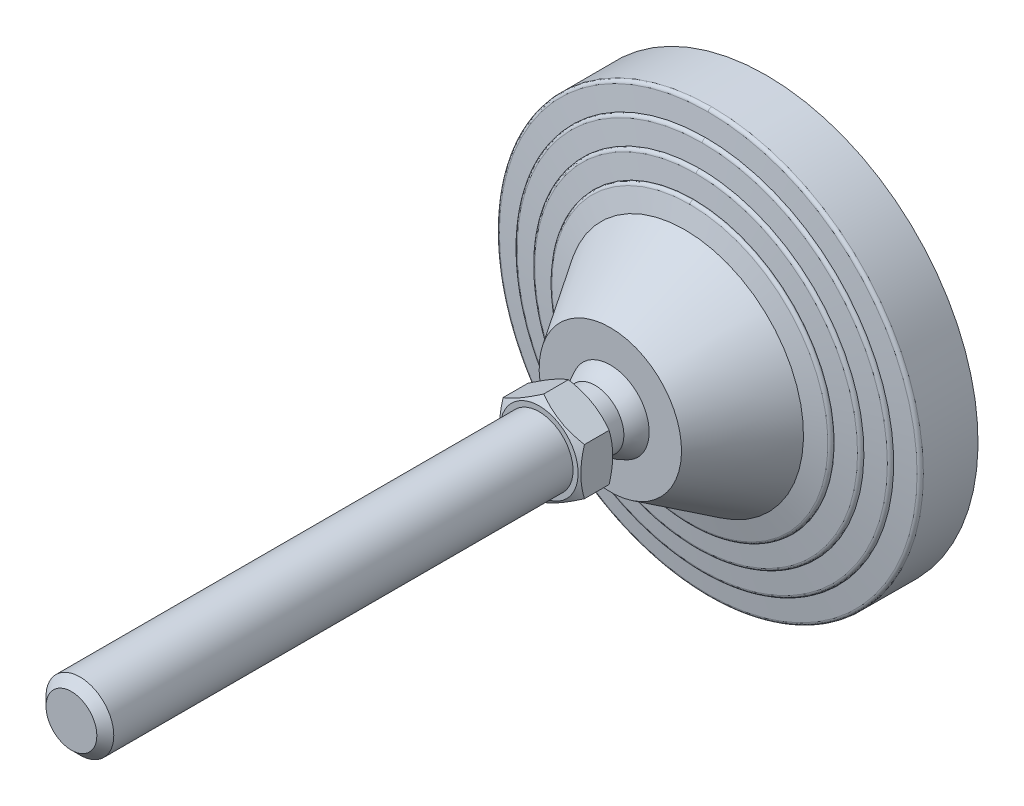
ISO-10303-21;
HEADER;
FILE_DESCRIPTION(('STEP AP214'),'2;1');
FILE_NAME('part.step','',(''),(''),'','','');
FILE_SCHEMA(('AUTOMOTIVE_DESIGN { 1 0 10303 214 1 1 1 1 }'));
ENDSEC;
DATA;
#1=APPLICATION_CONTEXT('core data for automotive mechanical design processes');
#2=APPLICATION_PROTOCOL_DEFINITION('international standard','automotive_design',2000,#1);
#3=PRODUCT_CONTEXT('',#1,'mechanical');
#4=PRODUCT('Part','Part','',(#3));
#5=PRODUCT_RELATED_PRODUCT_CATEGORY('part','',(#4));
#6=PRODUCT_DEFINITION_FORMATION('','',#4);
#7=PRODUCT_DEFINITION_CONTEXT('part definition',#1,'design');
#8=PRODUCT_DEFINITION('design','',#6,#7);
#9=PRODUCT_DEFINITION_SHAPE('','',#8);
#10=(LENGTH_UNIT() NAMED_UNIT(*) SI_UNIT(.MILLI.,.METRE.));
#11=(NAMED_UNIT(*) PLANE_ANGLE_UNIT() SI_UNIT($,.RADIAN.));
#12=(NAMED_UNIT(*) SI_UNIT($,.STERADIAN.) SOLID_ANGLE_UNIT());
#13=UNCERTAINTY_MEASURE_WITH_UNIT(LENGTH_MEASURE(1.E-05),#10,'distance_accuracy_value','');
#14=(GEOMETRIC_REPRESENTATION_CONTEXT(3) GLOBAL_UNCERTAINTY_ASSIGNED_CONTEXT((#13)) GLOBAL_UNIT_ASSIGNED_CONTEXT((#10,
#11,#12)) REPRESENTATION_CONTEXT('',''));
#15=CARTESIAN_POINT('',(0.,0.,0.));
#16=DIRECTION('',(0.,0.,1.));
#17=DIRECTION('',(1.,0.,0.));
#18=AXIS2_PLACEMENT_3D('',#15,#16,#17);
#19=CARTESIAN_POINT('',(-63.467641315,63.25,0.));
#20=DIRECTION('',(0.,0.,1.));
#21=DIRECTION('',(0.,-1.,0.));
#22=AXIS2_PLACEMENT_3D('',#19,#20,#21);
#23=PLANE('',#22);
#24=CARTESIAN_POINT('',(0.,0.,0.));
#25=DIRECTION('',(0.,0.,-1.));
#26=DIRECTION('',(0.,1.,0.));
#27=AXIS2_PLACEMENT_3D('',#24,#25,#26);
#28=CIRCLE('',#27,62.5);
#29=CARTESIAN_POINT('',(0.,62.5,0.));
#30=VERTEX_POINT('',#29);
#31=EDGE_CURVE('E243',#30,#30,#28,.F.);
#32=ORIENTED_EDGE('',*,*,#31,.F.);
#33=EDGE_LOOP('',(#32));
#34=FACE_BOUND('',#33,.T.);
#35=ADVANCED_FACE('F14',(#34),#23,.F.);
#36=CARTESIAN_POINT('',(0.,0.,16.119206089));
#37=DIRECTION('',(0.,0.,-1.));
#38=DIRECTION('',(0.,1.,0.));
#39=AXIS2_PLACEMENT_3D('',#36,#37,#38);
#40=CYLINDRICAL_SURFACE('',#39,62.5);
#41=ORIENTED_EDGE('',*,*,#31,.T.);
#42=EDGE_LOOP('',(#41));
#43=FACE_BOUND('',#42,.T.);
#44=CARTESIAN_POINT('',(0.,0.,16.119206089));
#45=DIRECTION('',(0.,0.,1.));
#46=DIRECTION('',(0.,-1.,0.));
#47=AXIS2_PLACEMENT_3D('',#44,#45,#46);
#48=CIRCLE('',#47,62.5);
#49=CARTESIAN_POINT('',(-6.4094821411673E-09,-62.5,16.119206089));
#50=VERTEX_POINT('',#49);
#51=CARTESIAN_POINT('',(0.,62.5,16.119206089));
#52=VERTEX_POINT('',#51);
#53=EDGE_CURVE('E522',#50,#52,#48,.T.);
#54=ORIENTED_EDGE('',*,*,#53,.F.);
#55=CARTESIAN_POINT('',(0.,0.,16.119206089));
#56=DIRECTION('',(0.,0.,1.));
#57=DIRECTION('',(0.,-1.,0.));
#58=AXIS2_PLACEMENT_3D('',#55,#56,#57);
#59=CIRCLE('',#58,62.5);
#60=EDGE_CURVE('E245',#52,#50,#59,.T.);
#61=ORIENTED_EDGE('',*,*,#60,.F.);
#62=EDGE_LOOP('',(#54,#61));
#63=FACE_BOUND('',#62,.T.);
#64=ADVANCED_FACE('F387',(#43,#63),#40,.T.);
#65=CARTESIAN_POINT('',(0.,-62.5,16.119206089));
#66=CARTESIAN_POINT('',(-125.,-62.5,16.119206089));
#67=CARTESIAN_POINT('',(-125.,62.5,16.119206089));
#68=CARTESIAN_POINT('',(0.,62.5,16.119206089));
#69=CARTESIAN_POINT('',(0.,-62.5,16.647800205));
#70=CARTESIAN_POINT('',(-125.,-62.5,16.647800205));
#71=CARTESIAN_POINT('',(-125.,62.5,16.647800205));
#72=CARTESIAN_POINT('',(0.,62.5,16.647800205));
#73=CARTESIAN_POINT('',(0.,-62.150618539,17.044466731));
#74=CARTESIAN_POINT('',(-124.301237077,-62.150618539,17.044466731));
#75=CARTESIAN_POINT('',(-124.301237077,62.150618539,17.044466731));
#76=CARTESIAN_POINT('',(0.,62.150618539,17.044466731));
#77=CARTESIAN_POINT('',(0.,-61.62625428,17.111204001));
#78=CARTESIAN_POINT('',(-123.252508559,-61.6262542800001,17.111204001));
#79=CARTESIAN_POINT('',(-123.252508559,61.6262542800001,17.111204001));
#80=CARTESIAN_POINT('',(0.,61.62625428,17.111204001));
#81=(BOUNDED_SURFACE() B_SPLINE_SURFACE(3,3,((#65,#66,#67,#68),(#69,#70,#71,#72),(#73,#74,#75,
#76),(#77,#78,#79,#80)),.UNSPECIFIED.,.F.,.F.,.F.) B_SPLINE_SURFACE_WITH_KNOTS((4,4),(4,4),(0.,
1.),(0.,1.),.UNSPECIFIED.) GEOMETRIC_REPRESENTATION_ITEM() RATIONAL_B_SPLINE_SURFACE(((1.,
0.333333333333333,0.333333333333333,1.),(0.833611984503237,0.277870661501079,0.277870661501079,
0.833611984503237),(0.833611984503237,0.277870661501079,0.277870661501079,0.833611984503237),
(1.,0.333333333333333,0.333333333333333,1.))) REPRESENTATION_ITEM('') SURFACE());
#82=CARTESIAN_POINT('',(0.,62.5,16.119206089));
#83=CARTESIAN_POINT('',(0.,62.5,16.647800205));
#84=CARTESIAN_POINT('',(0.,62.150618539,17.044466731));
#85=CARTESIAN_POINT('',(0.,61.62625428,17.111204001));
#86=(BOUNDED_CURVE() B_SPLINE_CURVE(3,(#82,#83,#84,#85),.UNSPECIFIED.,.F.,
.F.) B_SPLINE_CURVE_WITH_KNOTS((4,4),(0.,1.),
.UNSPECIFIED.) CURVE() GEOMETRIC_REPRESENTATION_ITEM() RATIONAL_B_SPLINE_CURVE((1.,
0.833611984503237,0.833611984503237,1.)) REPRESENTATION_ITEM(''));
#87=CARTESIAN_POINT('',(0.,61.6262542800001,17.111204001));
#88=VERTEX_POINT('',#87);
#89=EDGE_CURVE('E513',#52,#88,#86,.T.);
#90=CARTESIAN_POINT('',(0.,-62.5,16.119206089));
#91=CARTESIAN_POINT('',(0.,-62.5,16.647800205));
#92=CARTESIAN_POINT('',(0.,-62.150618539,17.044466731));
#93=CARTESIAN_POINT('',(0.,-61.62625428,17.111204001));
#94=(BOUNDED_CURVE() B_SPLINE_CURVE(3,(#90,#91,#92,#93),.UNSPECIFIED.,.F.,
.F.) B_SPLINE_CURVE_WITH_KNOTS((4,4),(0.,1.),
.UNSPECIFIED.) CURVE() GEOMETRIC_REPRESENTATION_ITEM() RATIONAL_B_SPLINE_CURVE((1.,
0.833611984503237,0.833611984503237,1.)) REPRESENTATION_ITEM(''));
#95=CARTESIAN_POINT('',(-1.89596340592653E-08,-61.6262542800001,17.111204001));
#96=VERTEX_POINT('',#95);
#97=EDGE_CURVE('E248',#96,#50,#94,.F.);
#98=CARTESIAN_POINT('',(0.,0.,17.111204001));
#99=DIRECTION('',(0.,0.,-1.));
#100=DIRECTION('',(0.,1.,0.));
#101=AXIS2_PLACEMENT_3D('',#98,#99,#100);
#102=CIRCLE('',#101,61.62625428);
#103=EDGE_CURVE('E506',#88,#96,#102,.F.);
#104=ORIENTED_EDGE('',*,*,#89,.F.);
#105=ORIENTED_EDGE('',*,*,#60,.T.);
#106=ORIENTED_EDGE('',*,*,#97,.F.);
#107=ORIENTED_EDGE('',*,*,#103,.F.);
#108=EDGE_LOOP('',(#104,#105,#106,#107));
#109=FACE_BOUND('',#108,.T.);
#110=ADVANCED_FACE('F693',(#109),#81,.T.);
#111=CARTESIAN_POINT('',(0.,62.5,16.119206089));
#112=CARTESIAN_POINT('',(125.,62.5,16.119206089));
#113=CARTESIAN_POINT('',(125.,-62.5,16.119206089));
#114=CARTESIAN_POINT('',(0.,-62.5,16.119206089));
#115=CARTESIAN_POINT('',(0.,62.5,16.647800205));
#116=CARTESIAN_POINT('',(125.,62.5,16.647800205));
#117=CARTESIAN_POINT('',(125.,-62.5,16.647800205));
#118=CARTESIAN_POINT('',(0.,-62.5,16.647800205));
#119=CARTESIAN_POINT('',(0.,62.150618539,17.044466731));
#120=CARTESIAN_POINT('',(124.301237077,62.150618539,17.044466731));
#121=CARTESIAN_POINT('',(124.301237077,-62.150618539,17.044466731));
#122=CARTESIAN_POINT('',(0.,-62.150618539,17.044466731));
#123=CARTESIAN_POINT('',(0.,61.62625428,17.111204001));
#124=CARTESIAN_POINT('',(123.252508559,61.6262542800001,17.111204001));
#125=CARTESIAN_POINT('',(123.252508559,-61.6262542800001,17.111204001));
#126=CARTESIAN_POINT('',(0.,-61.62625428,17.111204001));
#127=(BOUNDED_SURFACE() B_SPLINE_SURFACE(3,3,((#111,#112,#113,#114),(#115,#116,#117,#118),(#119,
#120,#121,#122),(#123,#124,#125,#126)),.UNSPECIFIED.,.F.,.F.,
.F.) B_SPLINE_SURFACE_WITH_KNOTS((4,4),(4,4),(0.,1.),(0.,1.),
.UNSPECIFIED.) GEOMETRIC_REPRESENTATION_ITEM() RATIONAL_B_SPLINE_SURFACE(((1.,0.333333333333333,
0.333333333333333,1.),(0.833611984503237,0.277870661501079,0.277870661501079,0.833611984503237),
(0.833611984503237,0.277870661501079,0.277870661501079,0.833611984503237),(1.,0.333333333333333,
0.333333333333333,1.))) REPRESENTATION_ITEM('') SURFACE());
#128=CARTESIAN_POINT('',(0.,0.,17.111204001));
#129=DIRECTION('',(0.,0.,-1.));
#130=DIRECTION('',(0.,1.,0.));
#131=AXIS2_PLACEMENT_3D('',#128,#129,#130);
#132=CIRCLE('',#131,61.62625428);
#133=EDGE_CURVE('E512',#96,#88,#132,.F.);
#134=ORIENTED_EDGE('',*,*,#53,.T.);
#135=ORIENTED_EDGE('',*,*,#89,.T.);
#136=ORIENTED_EDGE('',*,*,#133,.F.);
#137=ORIENTED_EDGE('',*,*,#97,.T.);
#138=EDGE_LOOP('',(#134,#135,#136,#137));
#139=FACE_BOUND('',#138,.T.);
#140=ADVANCED_FACE('F229',(#139),#127,.T.);
#141=CARTESIAN_POINT('',(0.,0.,17.890909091));
#142=DIRECTION('',(0.,0.,-1.));
#143=DIRECTION('',(0.,1.,0.));
#144=AXIS2_PLACEMENT_3D('',#141,#142,#143);
#145=CONICAL_SURFACE('',#144,55.5,1.44420419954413);
#146=ORIENTED_EDGE('',*,*,#103,.T.);
#147=ORIENTED_EDGE('',*,*,#133,.T.);
#148=EDGE_LOOP('',(#146,#147));
#149=FACE_BOUND('',#148,.T.);
#150=CARTESIAN_POINT('',(-1.13830957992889E-08,-55.5,17.890909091));
#151=CARTESIAN_POINT('',(0.666810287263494,-55.5000058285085,17.890909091));
#152=CARTESIAN_POINT('',(1.33362158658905,-55.4879831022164,17.890909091));
#153=CARTESIAN_POINT('',(2.66828219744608,-55.4398527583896,17.890909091));
#154=CARTESIAN_POINT('',(3.3361290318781,-55.4036764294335,17.890909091));
#155=CARTESIAN_POINT('',(4.67008368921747,-55.3072108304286,17.890909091));
#156=CARTESIAN_POINT('',(5.3361914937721,-55.2469213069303,17.890909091));
#157=CARTESIAN_POINT('',(6.66630694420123,-55.1022519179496,17.890909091));
#158=CARTESIAN_POINT('',(7.33031261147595,-55.0178537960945,17.890909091));
#159=CARTESIAN_POINT('',(8.65488946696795,-54.8250946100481,17.890909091));
#160=CARTESIAN_POINT('',(9.31546019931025,-54.7167304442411,17.890909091));
#161=CARTESIAN_POINT('',(11.3032442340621,-54.3535835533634,17.890909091));
#162=CARTESIAN_POINT('',(12.6239565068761,-54.0621103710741,17.890909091));
#163=CARTESIAN_POINT('',(15.2407929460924,-53.3834839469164,17.890909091));
#164=CARTESIAN_POINT('',(16.5369104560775,-52.9963051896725,17.890909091));
#165=CARTESIAN_POINT('',(19.098935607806,-52.1278427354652,17.890909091));
#166=CARTESIAN_POINT('',(20.3648068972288,-51.6464516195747,17.890909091));
#167=CARTESIAN_POINT('',(22.857943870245,-50.5924539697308,17.890909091));
#168=CARTESIAN_POINT('',(24.0852091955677,-50.0198465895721,17.890909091));
#169=CARTESIAN_POINT('',(26.6786676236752,-48.6922162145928,17.890909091));
#170=CARTESIAN_POINT('',(28.0374663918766,-47.9226902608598,17.890909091));
#171=CARTESIAN_POINT('',(30.6855194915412,-46.2718474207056,17.890909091));
#172=CARTESIAN_POINT('',(31.9747656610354,-45.3905174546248,17.890909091));
#173=CARTESIAN_POINT('',(34.4745529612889,-43.522294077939,17.890909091));
#174=CARTESIAN_POINT('',(35.6850872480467,-42.5353915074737,17.890909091));
#175=CARTESIAN_POINT('',(38.0186685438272,-40.4631409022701,17.890909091));
#176=CARTESIAN_POINT('',(39.141718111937,-39.377795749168,17.890909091));
#177=CARTESIAN_POINT('',(41.2923479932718,-37.1163936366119,17.890909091));
#178=CARTESIAN_POINT('',(42.319931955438,-35.9403401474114,17.890909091));
#179=CARTESIAN_POINT('',(44.2723789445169,-33.5058382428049,17.890909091));
#180=CARTESIAN_POINT('',(45.1972412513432,-32.2473892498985,17.890909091));
#181=CARTESIAN_POINT('',(46.9376312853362,-29.657095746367,17.890909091));
#182=CARTESIAN_POINT('',(47.7531628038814,-28.3252537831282,17.890909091));
#183=CARTESIAN_POINT('',(49.2691299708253,-25.5976050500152,17.890909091));
#184=CARTESIAN_POINT('',(49.9695658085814,-24.2017983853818,17.890909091));
#185=CARTESIAN_POINT('',(51.2503706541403,-21.3561258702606,17.890909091));
#186=CARTESIAN_POINT('',(51.8307383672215,-19.9062594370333,17.890909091));
#187=CARTESIAN_POINT('',(52.8672716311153,-16.9627885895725,17.890909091));
#188=CARTESIAN_POINT('',(53.3234371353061,-15.4691841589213,17.890909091));
#189=CARTESIAN_POINT('',(54.1083272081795,-12.448838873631,17.890909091));
#190=CARTESIAN_POINT('',(54.4370503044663,-10.9220976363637,17.890909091));
#191=CARTESIAN_POINT('',(54.9647110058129,-7.84634988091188,17.890909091));
#192=CARTESIAN_POINT('',(55.1636486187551,-6.29734336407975,17.890909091));
#193=CARTESIAN_POINT('',(55.4303245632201,-3.1880715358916,17.890909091));
#194=CARTESIAN_POINT('',(55.4980623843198,-1.6278061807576,17.890909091));
#195=CARTESIAN_POINT('',(55.5018556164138,1.49288460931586,17.890909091));
#196=CARTESIAN_POINT('',(55.4379110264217,3.05331004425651,17.890909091));
#197=CARTESIAN_POINT('',(55.1787965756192,6.16319684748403,17.890909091));
#198=CARTESIAN_POINT('',(54.9836292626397,7.71265842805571,17.890909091));
#199=CARTESIAN_POINT('',(54.4634594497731,10.7896325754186,17.890909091));
#200=CARTESIAN_POINT('',(54.1384569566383,12.3171451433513,17.890909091));
#201=CARTESIAN_POINT('',(53.360933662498,15.3393372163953,17.890909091));
#202=CARTESIAN_POINT('',(52.9084149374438,16.8340172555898,17.890909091));
#203=CARTESIAN_POINT('',(51.8790738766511,19.779944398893,17.890909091));
#204=CARTESIAN_POINT('',(51.3022515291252,21.2311914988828,17.890909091));
#205=CARTESIAN_POINT('',(50.0283709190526,24.0800097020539,17.890909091));
#206=CARTESIAN_POINT('',(49.3313064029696,25.4775780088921,17.890909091));
#207=CARTESIAN_POINT('',(47.8219174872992,28.2090226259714,17.890909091));
#208=CARTESIAN_POINT('',(47.0095931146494,29.5428989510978,17.890909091));
#209=CARTESIAN_POINT('',(45.2754391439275,32.1375097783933,17.890909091));
#210=CARTESIAN_POINT('',(44.3536065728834,33.3982422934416,17.890909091));
#211=CARTESIAN_POINT('',(42.4069961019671,35.8375708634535,17.890909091));
#212=CARTESIAN_POINT('',(41.3822180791,37.016166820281,17.890909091));
#213=CARTESIAN_POINT('',(39.2371577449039,39.2826945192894,17.890909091));
#214=CARTESIAN_POINT('',(38.1168855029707,40.3706357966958,17.890909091));
#215=CARTESIAN_POINT('',(35.7885615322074,42.4483529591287,17.890909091));
#216=CARTESIAN_POINT('',(34.5805102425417,43.438129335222,17.890909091));
#217=CARTESIAN_POINT('',(32.5014047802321,44.9999063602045,17.890909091));
#218=CARTESIAN_POINT('',(31.6521856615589,45.6012216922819,17.890909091));
#219=CARTESIAN_POINT('',(29.9212415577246,46.7552239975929,17.890909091));
#220=CARTESIAN_POINT('',(29.039516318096,47.3079105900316,17.890909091));
#221=CARTESIAN_POINT('',(27.2463975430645,48.3628576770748,17.890909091));
#222=CARTESIAN_POINT('',(26.335003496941,48.8651173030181,17.890909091));
#223=CARTESIAN_POINT('',(24.4853750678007,49.8176528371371,17.890909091));
#224=CARTESIAN_POINT('',(23.5471392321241,50.2679259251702,17.890909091));
#225=CARTESIAN_POINT('',(21.6468644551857,51.1150215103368,17.890909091));
#226=CARTESIAN_POINT('',(20.68482591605,51.5118449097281,17.890909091));
#227=CARTESIAN_POINT('',(18.7400290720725,52.2507726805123,17.890909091));
#228=CARTESIAN_POINT('',(17.7572723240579,52.5928811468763,17.890909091));
#229=CARTESIAN_POINT('',(15.8636176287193,53.1929617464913,17.890909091));
#230=CARTESIAN_POINT('',(14.9542390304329,53.4557406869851,17.890909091));
#231=CARTESIAN_POINT('',(13.1232854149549,53.9344479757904,17.890909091));
#232=CARTESIAN_POINT('',(12.2017111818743,54.1503793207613,17.890909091));
#233=CARTESIAN_POINT('',(10.3487557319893,54.5348378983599,17.890909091));
#234=CARTESIAN_POINT('',(9.41737477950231,54.7033664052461,17.890909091));
#235=CARTESIAN_POINT('',(7.54728204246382,54.992578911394,17.890909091));
#236=CARTESIAN_POINT('',(6.6085707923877,55.1132663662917,17.890909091));
#237=CARTESIAN_POINT('',(4.72616569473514,55.3064952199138,17.890909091));
#238=CARTESIAN_POINT('',(3.78247163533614,55.3790345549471,17.890909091));
#239=CARTESIAN_POINT('',(1.89251924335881,55.4758006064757,17.890909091));
#240=CARTESIAN_POINT('',(0.946260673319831,55.5000226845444,17.890909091));
#241=CARTESIAN_POINT('',(-1.66116426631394E-09,55.5,17.890909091));
#242=B_SPLINE_CURVE_WITH_KNOTS('',3,(#150,#151,#152,#153,#154,#155,#156,#157,#158,#159,#160,
#161,#162,#163,#164,#165,#166,#167,#168,#169,#170,#171,#172,#173,#174,#175,#176,#177,#178,#179,
#180,#181,#182,#183,#184,#185,#186,#187,#188,#189,#190,#191,#192,#193,#194,#195,#196,#197,#198,
#199,#200,#201,#202,#203,#204,#205,#206,#207,#208,#209,#210,#211,#212,#213,#214,#215,#216,#217,
#218,#219,#220,#221,#222,#223,#224,#225,#226,#227,#228,#229,#230,#231,#232,#233,#234,#235,#236,
#237,#238,#239,#240,#241),.UNSPECIFIED.,.F.,.F.,(4,2,2,2,2,2,2,2,2,2,2,2,2,2,2,2,2,2,2,2,2,2,2,
2,2,2,2,2,2,2,2,2,2,2,2,2,2,2,2,2,2,2,2,2,2,4),(0.,2.00032482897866,4.00636450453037,
6.01242526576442,8.02000917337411,10.0278530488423,14.0813911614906,18.1360111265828,
22.1952813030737,26.2545891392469,30.9336173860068,35.6131935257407,40.293176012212,
44.9730215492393,49.6526881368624,54.3323875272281,59.011924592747,63.6914539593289,
68.3710337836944,73.0506153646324,77.7302510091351,82.4098863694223,87.0895399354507,
91.7691935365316,96.4487562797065,101.128318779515,105.807805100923,110.487291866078,
115.167022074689,119.846751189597,124.526607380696,129.206469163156,133.885838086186,
138.565183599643,141.685351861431,144.80554455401,147.925790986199,151.046206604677,
154.166569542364,157.286698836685,160.125236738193,162.963593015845,165.801872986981,
168.63994790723,171.478144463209,174.316613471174),.UNSPECIFIED.);
#243=CARTESIAN_POINT('',(-1.13832320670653E-08,-55.5,17.895966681));
#244=VERTEX_POINT('',#243);
#245=CARTESIAN_POINT('',(-1.66118212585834E-09,55.5,17.895966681));
#246=VERTEX_POINT('',#245);
#247=EDGE_CURVE('E210',#244,#246,#242,.T.);
#248=ORIENTED_EDGE('',*,*,#247,.F.);
#249=CARTESIAN_POINT('',(-1.66117986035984E-09,55.5,17.890909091));
#250=CARTESIAN_POINT('',(-0.666810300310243,55.5000058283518,17.890909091));
#251=CARTESIAN_POINT('',(-1.33362159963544,55.4879831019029,17.890909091));
#252=CARTESIAN_POINT('',(-2.66828221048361,55.4398527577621,17.890909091));
#253=CARTESIAN_POINT('',(-3.33612904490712,55.403676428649,17.890909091));
#254=CARTESIAN_POINT('',(-4.67008370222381,55.3072108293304,17.890909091));
#255=CARTESIAN_POINT('',(-5.33619150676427,55.2469213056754,17.890909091));
#256=CARTESIAN_POINT('',(-6.66630695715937,55.1022519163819,17.890909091));
#257=CARTESIAN_POINT('',(-7.33031262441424,55.0178537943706,17.890909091));
#258=CARTESIAN_POINT('',(-8.6548894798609,54.8250946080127,17.890909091));
#259=CARTESIAN_POINT('',(-9.31546021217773,54.7167304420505,17.890909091));
#260=CARTESIAN_POINT('',(-11.3032442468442,54.3535835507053,17.890909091));
#261=CARTESIAN_POINT('',(-12.6239565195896,54.0621103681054,17.890909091));
#262=CARTESIAN_POINT('',(-15.2407929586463,53.3834839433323,17.890909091));
#263=CARTESIAN_POINT('',(-16.5369104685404,52.9963051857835,17.890909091));
#264=CARTESIAN_POINT('',(-19.0989356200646,52.1278427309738,17.890909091));
#265=CARTESIAN_POINT('',(-20.3648069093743,51.6464516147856,17.890909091));
#266=CARTESIAN_POINT('',(-22.8579438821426,50.5924539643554,17.890909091));
#267=CARTESIAN_POINT('',(-24.0852092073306,50.0198465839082,17.890909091));
#268=CARTESIAN_POINT('',(-26.6786676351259,48.6922162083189,17.890909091));
#269=CARTESIAN_POINT('',(-28.0374664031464,47.9226902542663,17.890909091));
#270=CARTESIAN_POINT('',(-30.6855195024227,46.2718474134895,17.890909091));
#271=CARTESIAN_POINT('',(-31.9747656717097,45.3905174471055,17.890909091));
#272=CARTESIAN_POINT('',(-34.4745529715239,43.5222940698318,17.890909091));
#273=CARTESIAN_POINT('',(-35.6850872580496,42.5353914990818,17.890909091));
#274=CARTESIAN_POINT('',(-38.0186685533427,40.4631408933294,17.890909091));
#275=CARTESIAN_POINT('',(-39.1417181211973,39.3777957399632,17.890909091));
#276=CARTESIAN_POINT('',(-41.2923480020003,37.1163936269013,17.890909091));
#277=CARTESIAN_POINT('',(-42.3199319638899,35.9403401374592,17.890909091));
#278=CARTESIAN_POINT('',(-44.2723789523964,33.5058382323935,17.890909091));
#279=CARTESIAN_POINT('',(-45.1972412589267,32.2473892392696,17.890909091));
#280=CARTESIAN_POINT('',(-46.9376312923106,29.6570957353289,17.890909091));
#281=CARTESIAN_POINT('',(-47.7531628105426,28.3252537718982,17.890909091));
#282=CARTESIAN_POINT('',(-49.269129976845,25.5976050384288,17.890909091));
#283=CARTESIAN_POINT('',(-49.9695658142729,24.2017983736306,17.890909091));
#284=CARTESIAN_POINT('',(-51.2503706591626,21.3561258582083,17.890909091));
#285=CARTESIAN_POINT('',(-51.8307383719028,19.9062594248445,17.890909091));
#286=CARTESIAN_POINT('',(-52.8672716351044,16.9627885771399,17.890909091));
#287=CARTESIAN_POINT('',(-53.3234371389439,15.4691841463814,17.890909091));
#288=CARTESIAN_POINT('',(-54.108327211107,12.4488388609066,17.890909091));
#289=CARTESIAN_POINT('',(-54.4370503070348,10.9220976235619,17.890909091));
#290=CARTESIAN_POINT('',(-54.964711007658,7.84634986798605,17.890909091));
#291=CARTESIAN_POINT('',(-55.163648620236,6.29734335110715,17.890909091));
#292=CARTESIAN_POINT('',(-55.4303245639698,3.18807152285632,17.890909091));
#293=CARTESIAN_POINT('',(-55.4980623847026,1.62780616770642,17.890909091));
#294=CARTESIAN_POINT('',(-55.5018556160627,-1.49288462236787,17.890909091));
#295=CARTESIAN_POINT('',(-55.4379110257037,-3.05331005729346,17.890909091));
#296=CARTESIAN_POINT('',(-55.1787965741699,-6.16319686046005,17.890909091));
#297=CARTESIAN_POINT('',(-54.983629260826,-7.71265844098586,17.890909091));
#298=CARTESIAN_POINT('',(-54.4634594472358,-10.7896325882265,17.890909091));
#299=CARTESIAN_POINT('',(-54.1384569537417,-12.3171451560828,17.890909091));
#300=CARTESIAN_POINT('',(-53.3609336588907,-15.3393372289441,17.890909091));
#301=CARTESIAN_POINT('',(-52.908414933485,-16.8340172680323,17.890909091));
#302=CARTESIAN_POINT('',(-51.8790738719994,-19.7799444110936,17.890909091));
#303=CARTESIAN_POINT('',(-51.3022515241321,-21.231191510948,17.890909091));
#304=CARTESIAN_POINT('',(-50.0283709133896,-24.0800097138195,17.890909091));
#305=CARTESIAN_POINT('',(-49.3313063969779,-25.4775780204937,17.890909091));
#306=CARTESIAN_POINT('',(-47.8219174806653,-28.2090226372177,17.890909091));
#307=CARTESIAN_POINT('',(-47.0095931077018,-29.542898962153,17.890909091));
#308=CARTESIAN_POINT('',(-45.2754391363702,-32.1375097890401,17.890909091));
#309=CARTESIAN_POINT('',(-44.3536065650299,-33.3982423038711,17.890909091));
#310=CARTESIAN_POINT('',(-42.4069960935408,-35.8375708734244,17.890909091));
#311=CARTESIAN_POINT('',(-41.3822180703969,-37.0161668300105,17.890909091));
#312=CARTESIAN_POINT('',(-39.2371577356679,-39.2826945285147,17.890909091));
#313=CARTESIAN_POINT('',(-38.1168854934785,-40.3706358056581,17.890909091));
#314=CARTESIAN_POINT('',(-35.7885615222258,-42.4483529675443,17.890909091));
#315=CARTESIAN_POINT('',(-34.5805102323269,-43.4381293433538,17.890909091));
#316=CARTESIAN_POINT('',(-32.5014047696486,-44.9999063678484,17.890909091));
#317=CARTESIAN_POINT('',(-31.652185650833,-45.6012216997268,17.890909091));
#318=CARTESIAN_POINT('',(-29.9212415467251,-46.7552240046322,17.890909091));
#319=CARTESIAN_POINT('',(-29.0395163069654,-47.3079105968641,17.890909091));
#320=CARTESIAN_POINT('',(-27.2463975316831,-48.3628576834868,17.890909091));
#321=CARTESIAN_POINT('',(-26.33500348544,-48.8651173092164,17.890909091));
#322=CARTESIAN_POINT('',(-24.4853750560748,-49.8176528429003,17.890909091));
#323=CARTESIAN_POINT('',(-23.5471392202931,-50.2679259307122,17.890909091));
#324=CARTESIAN_POINT('',(-21.6468644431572,-51.1150215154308,17.890909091));
#325=CARTESIAN_POINT('',(-20.6848259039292,-51.5118449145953,17.890909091));
#326=CARTESIAN_POINT('',(-18.7400290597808,-52.2507726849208,17.890909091));
#327=CARTESIAN_POINT('',(-17.7572723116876,-52.5928811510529,17.890909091));
#328=CARTESIAN_POINT('',(-15.8636176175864,-53.1929617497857,17.890909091));
#329=CARTESIAN_POINT('',(-14.9542390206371,-53.4557406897,17.890909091));
#330=CARTESIAN_POINT('',(-13.1232854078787,-53.9344479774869,17.890909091));
#331=CARTESIAN_POINT('',(-12.2017111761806,-54.150379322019,17.890909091));
#332=CARTESIAN_POINT('',(-10.3487557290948,-54.534837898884,17.890909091));
#333=CARTESIAN_POINT('',(-9.41737477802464,-54.7033664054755,17.890909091));
#334=CARTESIAN_POINT('',(-7.54728204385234,-54.9925789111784,17.890909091));
#335=CARTESIAN_POINT('',(-6.60857079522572,-55.1132663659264,17.890909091));
#336=CARTESIAN_POINT('',(-4.72616570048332,-55.3064952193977,17.890909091));
#337=CARTESIAN_POINT('',(-3.78247164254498,-55.3790345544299,17.890909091));
#338=CARTESIAN_POINT('',(-1.89251925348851,-55.4758006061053,17.890909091));
#339=CARTESIAN_POINT('',(-0.946260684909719,-55.5000226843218,17.890909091));
#340=CARTESIAN_POINT('',(-1.13832325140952E-08,-55.5,17.890909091));
#341=B_SPLINE_CURVE_WITH_KNOTS('',3,(#249,#250,#251,#252,#253,#254,#255,#256,#257,#258,#259,
#260,#261,#262,#263,#264,#265,#266,#267,#268,#269,#270,#271,#272,#273,#274,#275,#276,#277,#278,
#279,#280,#281,#282,#283,#284,#285,#286,#287,#288,#289,#290,#291,#292,#293,#294,#295,#296,#297,
#298,#299,#300,#301,#302,#303,#304,#305,#306,#307,#308,#309,#310,#311,#312,#313,#314,#315,#316,
#317,#318,#319,#320,#321,#322,#323,#324,#325,#326,#327,#328,#329,#330,#331,#332,#333,#334,#335,
#336,#337,#338,#339,#340),.UNSPECIFIED.,.F.,.F.,(4,2,2,2,2,2,2,2,2,2,2,2,2,2,2,2,2,2,2,2,2,2,2,
2,2,2,2,2,2,2,2,2,2,2,2,2,2,2,2,2,2,2,2,2,2,4),(0.,2.00032482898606,4.00636450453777,
6.01242526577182,8.02000917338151,10.0278530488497,14.081391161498,18.1360111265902,
22.1952813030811,26.2545891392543,30.9336173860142,35.6131935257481,40.2931760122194,
44.9730215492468,49.6526881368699,54.3323875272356,59.0119245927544,63.6914539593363,
68.3710337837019,73.0506153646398,77.7302510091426,82.4098863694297,87.089539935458,
91.7691935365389,96.4487562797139,101.128318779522,105.807805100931,110.487291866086,
115.167022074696,119.846751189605,124.526607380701,129.20646916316,133.885838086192,
138.565183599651,141.685351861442,144.805544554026,147.925790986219,151.046206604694,
154.166569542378,157.286698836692,160.125236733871,162.963593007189,165.801872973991,
168.639947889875,171.47814444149,174.316613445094),.UNSPECIFIED.);
#342=EDGE_CURVE('E222',#246,#244,#341,.T.);
#343=ORIENTED_EDGE('',*,*,#342,.F.);
#344=EDGE_LOOP('',(#248,#343));
#345=FACE_BOUND('',#344,.T.);
#346=ADVANCED_FACE('F224',(#149,#345),#145,.T.);
#347=CARTESIAN_POINT('',(0.,-55.5,17.887804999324));
#348=CARTESIAN_POINT('',(-111.,-55.5000000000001,17.8878049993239));
#349=CARTESIAN_POINT('',(-111.,55.5000000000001,17.8878049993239));
#350=CARTESIAN_POINT('',(0.,55.5,17.887804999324));
#351=CARTESIAN_POINT('',(0.,-55.5,17.892211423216));
#352=CARTESIAN_POINT('',(-111.,-55.5000000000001,17.892211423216));
#353=CARTESIAN_POINT('',(-111.,55.5000000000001,17.892211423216));
#354=CARTESIAN_POINT('',(0.,55.5,17.892211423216));
#355=CARTESIAN_POINT('',(0.,-55.5,17.896617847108));
#356=CARTESIAN_POINT('',(-111.,-55.5000000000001,17.896617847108));
#357=CARTESIAN_POINT('',(-111.,55.5000000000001,17.896617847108));
#358=CARTESIAN_POINT('',(0.,55.5,17.896617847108));
#359=CARTESIAN_POINT('',(0.,-55.5,17.901024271));
#360=CARTESIAN_POINT('',(-111.,-55.5000000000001,17.901024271));
#361=CARTESIAN_POINT('',(-111.,55.5000000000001,17.901024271));
#362=CARTESIAN_POINT('',(0.,55.5,17.901024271));
#363=CARTESIAN_POINT('',(0.,-55.5,18.429618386));
#364=CARTESIAN_POINT('',(-111.,-55.5,18.429618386));
#365=CARTESIAN_POINT('',(-111.,55.5,18.429618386));
#366=CARTESIAN_POINT('',(0.,55.5,18.429618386));
#367=CARTESIAN_POINT('',(0.,-55.150618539,18.826284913));
#368=CARTESIAN_POINT('',(-110.301237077,-55.150618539,18.826284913));
#369=CARTESIAN_POINT('',(-110.301237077,55.150618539,18.826284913));
#370=CARTESIAN_POINT('',(0.,55.150618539,18.826284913));
#371=CARTESIAN_POINT('',(0.,-54.62625428,18.893022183));
#372=CARTESIAN_POINT('',(-109.252508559,-54.62625428,18.893022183));
#373=CARTESIAN_POINT('',(-109.252508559,54.62625428,18.893022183));
#374=CARTESIAN_POINT('',(0.,54.62625428,18.893022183));
#375=(BOUNDED_SURFACE() B_SPLINE_SURFACE(3,3,((#347,#348,#349,#350),(#351,#352,#353,#354),(#355,
#356,#357,#358),(#359,#360,#361,#362),(#363,#364,#365,#366),(#367,#368,#369,#370),(#371,#372,
#373,#374)),.UNSPECIFIED.,.F.,.F.,.F.) B_SPLINE_SURFACE_WITH_KNOTS((4,3,4),(4,4),(-0.01,0.,1.),
(0.,1.),.UNSPECIFIED.) GEOMETRIC_REPRESENTATION_ITEM() RATIONAL_B_SPLINE_SURFACE(((1.,
0.333333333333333,0.333333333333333,1.),(1.,0.333333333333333,0.333333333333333,1.),(1.,
0.333333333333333,0.333333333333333,1.),(1.,0.333333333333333,0.333333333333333,1.),
(0.833611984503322,0.277870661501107,0.277870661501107,0.833611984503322),(0.833611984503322,
0.277870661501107,0.277870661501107,0.833611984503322),(1.,0.333333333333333,0.333333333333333,1.))) REPRESENTATION_ITEM('') SURFACE());
#376=CARTESIAN_POINT('',(0.,55.5,17.901024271));
#377=CARTESIAN_POINT('',(0.,55.5,18.429618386));
#378=CARTESIAN_POINT('',(0.,55.150618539,18.826284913));
#379=CARTESIAN_POINT('',(0.,54.62625428,18.893022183));
#380=(BOUNDED_CURVE() B_SPLINE_CURVE(3,(#376,#377,#378,#379),.UNSPECIFIED.,.F.,
.F.) B_SPLINE_CURVE_WITH_KNOTS((4,4),(0.,1.),
.UNSPECIFIED.) CURVE() GEOMETRIC_REPRESENTATION_ITEM() RATIONAL_B_SPLINE_CURVE((1.,
0.833611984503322,0.833611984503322,1.)) REPRESENTATION_ITEM(''));
#381=CARTESIAN_POINT('',(0.,54.6262542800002,18.8930221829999));
#382=VERTEX_POINT('',#381);
#383=EDGE_CURVE('E213',#246,#382,#380,.T.);
#384=CARTESIAN_POINT('',(0.,-55.5,17.901024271));
#385=CARTESIAN_POINT('',(0.,-55.5,18.429618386));
#386=CARTESIAN_POINT('',(0.,-55.150618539,18.826284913));
#387=CARTESIAN_POINT('',(0.,-54.62625428,18.893022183));
#388=(BOUNDED_CURVE() B_SPLINE_CURVE(3,(#384,#385,#386,#387),.UNSPECIFIED.,.F.,
.F.) B_SPLINE_CURVE_WITH_KNOTS((4,4),(0.,1.),
.UNSPECIFIED.) CURVE() GEOMETRIC_REPRESENTATION_ITEM() RATIONAL_B_SPLINE_CURVE((1.,
0.833611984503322,0.833611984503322,1.)) REPRESENTATION_ITEM(''));
#389=CARTESIAN_POINT('',(-1.68060480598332E-08,-54.6262542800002,18.8930221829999));
#390=VERTEX_POINT('',#389);
#391=EDGE_CURVE('E214',#390,#244,#388,.F.);
#392=CARTESIAN_POINT('',(0.,0.,18.8930221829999));
#393=DIRECTION('',(0.,0.,-1.));
#394=DIRECTION('',(0.,1.,0.));
#395=AXIS2_PLACEMENT_3D('',#392,#393,#394);
#396=CIRCLE('',#395,54.62625428);
#397=EDGE_CURVE('E478',#382,#390,#396,.F.);
#398=ORIENTED_EDGE('',*,*,#383,.F.);
#399=ORIENTED_EDGE('',*,*,#342,.T.);
#400=ORIENTED_EDGE('',*,*,#391,.F.);
#401=ORIENTED_EDGE('',*,*,#397,.F.);
#402=EDGE_LOOP('',(#398,#399,#400,#401));
#403=FACE_BOUND('',#402,.T.);
#404=ADVANCED_FACE('F228',(#403),#375,.T.);
#405=CARTESIAN_POINT('',(0.,55.5,17.887804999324));
#406=CARTESIAN_POINT('',(111.,55.5000000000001,17.8878049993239));
#407=CARTESIAN_POINT('',(111.,-55.5000000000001,17.8878049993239));
#408=CARTESIAN_POINT('',(0.,-55.5,17.887804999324));
#409=CARTESIAN_POINT('',(0.,55.5,17.892211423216));
#410=CARTESIAN_POINT('',(111.,55.5000000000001,17.892211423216));
#411=CARTESIAN_POINT('',(111.,-55.5000000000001,17.892211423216));
#412=CARTESIAN_POINT('',(0.,-55.5,17.892211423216));
#413=CARTESIAN_POINT('',(0.,55.5,17.896617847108));
#414=CARTESIAN_POINT('',(111.,55.5000000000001,17.896617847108));
#415=CARTESIAN_POINT('',(111.,-55.5000000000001,17.896617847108));
#416=CARTESIAN_POINT('',(0.,-55.5,17.896617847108));
#417=CARTESIAN_POINT('',(0.,55.5,17.901024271));
#418=CARTESIAN_POINT('',(111.,55.5000000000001,17.901024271));
#419=CARTESIAN_POINT('',(111.,-55.5000000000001,17.901024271));
#420=CARTESIAN_POINT('',(0.,-55.5,17.901024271));
#421=CARTESIAN_POINT('',(0.,55.5,18.429618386));
#422=CARTESIAN_POINT('',(111.,55.5,18.429618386));
#423=CARTESIAN_POINT('',(111.,-55.5,18.429618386));
#424=CARTESIAN_POINT('',(0.,-55.5,18.429618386));
#425=CARTESIAN_POINT('',(0.,55.150618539,18.826284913));
#426=CARTESIAN_POINT('',(110.301237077,55.150618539,18.826284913));
#427=CARTESIAN_POINT('',(110.301237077,-55.150618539,18.826284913));
#428=CARTESIAN_POINT('',(0.,-55.150618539,18.826284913));
#429=CARTESIAN_POINT('',(0.,54.62625428,18.893022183));
#430=CARTESIAN_POINT('',(109.252508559,54.62625428,18.893022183));
#431=CARTESIAN_POINT('',(109.252508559,-54.62625428,18.893022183));
#432=CARTESIAN_POINT('',(0.,-54.62625428,18.893022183));
#433=(BOUNDED_SURFACE() B_SPLINE_SURFACE(3,3,((#405,#406,#407,#408),(#409,#410,#411,#412),(#413,
#414,#415,#416),(#417,#418,#419,#420),(#421,#422,#423,#424),(#425,#426,#427,#428),(#429,#430,
#431,#432)),.UNSPECIFIED.,.F.,.F.,.F.) B_SPLINE_SURFACE_WITH_KNOTS((4,3,4),(4,4),(-0.01,0.,1.),
(0.,1.),.UNSPECIFIED.) GEOMETRIC_REPRESENTATION_ITEM() RATIONAL_B_SPLINE_SURFACE(((1.,
0.333333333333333,0.333333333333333,1.),(1.,0.333333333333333,0.333333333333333,1.),(1.,
0.333333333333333,0.333333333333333,1.),(1.,0.333333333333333,0.333333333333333,1.),
(0.833611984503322,0.277870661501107,0.277870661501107,0.833611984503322),(0.833611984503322,
0.277870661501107,0.277870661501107,0.833611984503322),(1.,0.333333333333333,0.333333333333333,1.))) REPRESENTATION_ITEM('') SURFACE());
#434=CARTESIAN_POINT('',(0.,0.,18.8930221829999));
#435=DIRECTION('',(0.,0.,-1.));
#436=DIRECTION('',(0.,1.,0.));
#437=AXIS2_PLACEMENT_3D('',#434,#435,#436);
#438=CIRCLE('',#437,54.62625428);
#439=EDGE_CURVE('E484',#390,#382,#438,.F.);
#440=ORIENTED_EDGE('',*,*,#247,.T.);
#441=ORIENTED_EDGE('',*,*,#383,.T.);
#442=ORIENTED_EDGE('',*,*,#439,.F.);
#443=ORIENTED_EDGE('',*,*,#391,.T.);
#444=EDGE_LOOP('',(#440,#441,#442,#443));
#445=FACE_BOUND('',#444,.T.);
#446=ADVANCED_FACE('F194',(#445),#433,.T.);
#447=CARTESIAN_POINT('',(0.,0.,19.672727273));
#448=DIRECTION('',(0.,0.,-1.));
#449=DIRECTION('',(0.,1.,0.));
#450=AXIS2_PLACEMENT_3D('',#447,#448,#449);
#451=CONICAL_SURFACE('',#450,48.5,1.44420419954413);
#452=ORIENTED_EDGE('',*,*,#397,.T.);
#453=ORIENTED_EDGE('',*,*,#439,.T.);
#454=EDGE_LOOP('',(#452,#453));
#455=FACE_BOUND('',#454,.T.);
#456=CARTESIAN_POINT('',(-9.9473684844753E-09,-48.5,19.672727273));
#457=CARTESIAN_POINT('',(0.333415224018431,-48.4999999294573,19.672727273));
#458=CARTESIAN_POINT('',(0.666820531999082,-48.4965617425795,19.672727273));
#459=CARTESIAN_POINT('',(1.33352786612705,-48.4828103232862,19.672727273));
#460=CARTESIAN_POINT('',(1.66682987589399,-48.4724962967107,19.672727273));
#461=CARTESIAN_POINT('',(2.66872204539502,-48.4311451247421,19.672727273));
#462=CARTESIAN_POINT('',(3.33691272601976,-48.3896987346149,19.672727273));
#463=CARTESIAN_POINT('',(4.67104276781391,-48.2791827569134,19.672727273));
#464=CARTESIAN_POINT('',(5.336981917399,-48.2101106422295,19.672727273));
#465=CARTESIAN_POINT('',(6.66612914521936,-48.0443714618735,19.672727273));
#466=CARTESIAN_POINT('',(7.32933372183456,-47.9476761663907,19.672727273));
#467=CARTESIAN_POINT('',(8.65121670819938,-47.7268868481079,19.672727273));
#468=CARTESIAN_POINT('',(9.3098944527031,-47.6027888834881,19.672727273));
#469=CARTESIAN_POINT('',(11.2942742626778,-47.1861322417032,19.672727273));
#470=CARTESIAN_POINT('',(12.6113745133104,-46.8513167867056,19.672727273));
#471=CARTESIAN_POINT('',(15.2131663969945,-46.0722804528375,19.672727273));
#472=CARTESIAN_POINT('',(16.4978453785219,-45.6280175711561,19.672727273));
#473=CARTESIAN_POINT('',(19.0268967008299,-44.6326754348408,19.672727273));
#474=CARTESIAN_POINT('',(20.271221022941,-44.0814740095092,19.672727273));
#475=CARTESIAN_POINT('',(22.7090353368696,-42.8765478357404,19.672727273));
#476=CARTESIAN_POINT('',(23.9025301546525,-42.2228328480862,19.672727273));
#477=CARTESIAN_POINT('',(26.2339069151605,-40.8153372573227,19.672727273));
#478=CARTESIAN_POINT('',(27.3716102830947,-40.0612608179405,19.672727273));
#479=CARTESIAN_POINT('',(29.5794657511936,-38.4599142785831,19.672727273));
#480=CARTESIAN_POINT('',(30.6496160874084,-37.6126417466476,19.672727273));
#481=CARTESIAN_POINT('',(32.7144313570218,-35.8311972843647,19.672727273));
#482=CARTESIAN_POINT('',(33.7091176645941,-34.8970501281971,19.672727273));
#483=CARTESIAN_POINT('',(35.6162650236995,-32.948298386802,19.672727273));
#484=CARTESIAN_POINT('',(36.5287266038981,-31.9336943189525,19.672727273));
#485=CARTESIAN_POINT('',(38.2650470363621,-29.83111301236,19.672727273));
#486=CARTESIAN_POINT('',(39.0888956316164,-28.743127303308,19.672727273));
#487=CARTESIAN_POINT('',(40.6420135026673,-26.5016202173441,19.672727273));
#488=CARTESIAN_POINT('',(41.3712826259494,-25.3480987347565,19.672727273));
#489=CARTESIAN_POINT('',(42.7300878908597,-22.9836659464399,19.672727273));
#490=CARTESIAN_POINT('',(43.3596192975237,-21.7727519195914,19.672727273));
#491=CARTESIAN_POINT('',(44.5144313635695,-19.3021944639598,19.672727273));
#492=CARTESIAN_POINT('',(45.0397120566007,-18.0425510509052,19.672727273));
#493=CARTESIAN_POINT('',(45.9822772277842,-15.4835203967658,19.672727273));
#494=CARTESIAN_POINT('',(46.399564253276,-14.1841340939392,19.672727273));
#495=CARTESIAN_POINT('',(47.1231916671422,-11.5548271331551,19.672727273));
#496=CARTESIAN_POINT('',(47.4295320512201,-10.2249064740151,19.672727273));
#497=CARTESIAN_POINT('',(47.9290880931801,-7.5439866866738,19.672727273));
#498=CARTESIAN_POINT('',(48.1223038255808,-6.19298757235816,19.672727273));
#499=CARTESIAN_POINT('',(48.3942372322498,-3.47951480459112,19.672727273));
#500=CARTESIAN_POINT('',(48.4729549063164,-2.1170411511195,19.672727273));
#501=CARTESIAN_POINT('',(48.5153327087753,0.609703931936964,19.672727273));
#502=CARTESIAN_POINT('',(48.4789920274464,1.97397537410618,19.672727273));
#503=CARTESIAN_POINT('',(48.2915097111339,4.69460717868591,19.672727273));
#504=CARTESIAN_POINT('',(48.1403680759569,6.05096754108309,19.672727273));
#505=CARTESIAN_POINT('',(47.7243611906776,8.74611604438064,19.672727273));
#506=CARTESIAN_POINT('',(47.4594974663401,10.0849044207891,19.672727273));
#507=CARTESIAN_POINT('',(46.8179296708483,12.7354096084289,19.672727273));
#508=CARTESIAN_POINT('',(46.4412256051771,14.0471264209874,19.672727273));
#509=CARTESIAN_POINT('',(45.5786575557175,16.6341561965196,19.672727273));
#510=CARTESIAN_POINT('',(45.0927941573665,17.90946935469,19.672727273));
#511=CARTESIAN_POINT('',(44.0153602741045,20.4146329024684,19.672727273));
#512=CARTESIAN_POINT('',(43.4237897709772,21.6444832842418,19.672727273));
#513=CARTESIAN_POINT('',(42.13913189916,24.0500069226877,19.672727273));
#514=CARTESIAN_POINT('',(41.4460420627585,25.2256788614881,19.672727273));
#515=CARTESIAN_POINT('',(39.963283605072,27.5144547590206,19.672727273));
#516=CARTESIAN_POINT('',(39.1736150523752,28.6275587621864,19.672727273));
#517=CARTESIAN_POINT('',(37.5033313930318,30.7832641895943,19.672727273));
#518=CARTESIAN_POINT('',(36.6227180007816,31.8258669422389,19.672727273));
#519=CARTESIAN_POINT('',(34.7767800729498,33.8331893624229,19.672727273));
#520=CARTESIAN_POINT('',(33.8114552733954,34.7979087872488,19.672727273));
#521=CARTESIAN_POINT('',(31.8029804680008,36.642596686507,19.672727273));
#522=CARTESIAN_POINT('',(30.7598292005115,37.5225637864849,19.672727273));
#523=CARTESIAN_POINT('',(28.6030073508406,39.191539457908,19.672727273));
#524=CARTESIAN_POINT('',(27.4893376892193,39.9805492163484,19.672727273));
#525=CARTESIAN_POINT('',(25.5812150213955,41.2150302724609,19.672727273));
#526=CARTESIAN_POINT('',(24.8040020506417,41.6873877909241,19.672727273));
#527=CARTESIAN_POINT('',(23.2241951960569,42.587710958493,19.672727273));
#528=CARTESIAN_POINT('',(22.4216008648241,43.0156758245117,19.672727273));
#529=CARTESIAN_POINT('',(20.7935946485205,43.8258285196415,19.672727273));
#530=CARTESIAN_POINT('',(19.9681815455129,44.2080138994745,19.672727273));
#531=CARTESIAN_POINT('',(18.2974514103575,44.9252645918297,19.672727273));
#532=CARTESIAN_POINT('',(17.4521411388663,45.2603456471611,19.672727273));
#533=CARTESIAN_POINT('',(15.7440847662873,45.8824576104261,19.672727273));
#534=CARTESIAN_POINT('',(14.8813396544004,46.1694912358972,19.672727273));
#535=CARTESIAN_POINT('',(13.1412443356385,46.6945749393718,19.672727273));
#536=CARTESIAN_POINT('',(12.2638974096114,46.9326358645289,19.672727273));
#537=CARTESIAN_POINT('',(10.7597151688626,47.2957357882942,19.672727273));
#538=CARTESIAN_POINT('',(10.1358813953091,47.4333417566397,19.672727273));
#539=CARTESIAN_POINT('',(8.88335895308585,47.6837886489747,19.672727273));
#540=CARTESIAN_POINT('',(8.25467114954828,47.7966338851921,19.672727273));
#541=CARTESIAN_POINT('',(6.99338768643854,47.9973988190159,19.672727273));
#542=CARTESIAN_POINT('',(6.36079236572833,48.0853206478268,19.672727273));
#543=CARTESIAN_POINT('',(5.09345547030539,48.2360176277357,19.672727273));
#544=CARTESIAN_POINT('',(4.45871780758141,48.298825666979,19.672727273));
#545=CARTESIAN_POINT('',(3.18720376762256,48.3993639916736,19.672727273));
#546=CARTESIAN_POINT('',(2.55042721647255,48.4370920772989,19.672727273));
#547=CARTESIAN_POINT('',(1.27576743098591,48.4874158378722,19.672727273));
#548=CARTESIAN_POINT('',(0.637884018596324,48.5000070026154,19.672727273));
#549=CARTESIAN_POINT('',(-1.45164367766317E-09,48.5,19.672727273));
#550=B_SPLINE_CURVE_WITH_KNOTS('',3,(#456,#457,#458,#459,#460,#461,#462,#463,#464,#465,#466,
#467,#468,#469,#470,#471,#472,#473,#474,#475,#476,#477,#478,#479,#480,#481,#482,#483,#484,#485,
#486,#487,#488,#489,#490,#491,#492,#493,#494,#495,#496,#497,#498,#499,#500,#501,#502,#503,#504,
#505,#506,#507,#508,#509,#510,#511,#512,#513,#514,#515,#516,#517,#518,#519,#520,#521,#522,#523,
#524,#525,#526,#527,#528,#529,#530,#531,#532,#533,#534,#535,#536,#537,#538,#539,#540,#541,#542,
#543,#544,#545,#546,#547,#548,#549),.UNSPECIFIED.,.F.,.F.,(4,2,2,2,2,2,2,2,2,2,2,2,2,2,2,2,2,2,
2,2,2,2,2,2,2,2,2,2,2,2,2,2,2,2,2,2,2,2,2,2,2,2,2,2,2,2,4),(0.,1.00020813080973,
2.00053180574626,4.00833049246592,6.01631288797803,8.02635474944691,10.0366859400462,
14.1084255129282,18.1817301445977,22.259715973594,26.337313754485,30.4272089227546,
34.5172108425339,38.6060499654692,42.6948627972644,46.7841484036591,50.8734406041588,
54.9629268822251,59.0524118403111,63.1418003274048,67.2311889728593,71.3205749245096,
75.4099608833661,79.4993756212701,83.5887903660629,87.6781502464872,91.7675099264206,
95.8568476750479,99.9461861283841,104.03562400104,108.125058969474,112.214416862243,
116.303787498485,120.393224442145,124.482608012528,127.209786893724,129.937013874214,
132.664386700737,135.390845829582,138.117150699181,140.842851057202,142.758881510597,
144.674578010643,146.590110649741,148.503126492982,150.416310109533,152.329836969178),.UNSPECIFIED.);
#551=CARTESIAN_POINT('',(-9.94750910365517E-09,-48.5,19.677784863));
#552=VERTEX_POINT('',#551);
#553=CARTESIAN_POINT('',(-1.451663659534E-09,48.5,19.677784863));
#554=VERTEX_POINT('',#553);
#555=EDGE_CURVE('E168',#552,#554,#550,.T.);
#556=ORIENTED_EDGE('',*,*,#555,.F.);
#557=CARTESIAN_POINT('',(-1.45166167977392E-09,48.5,19.672727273));
#558=CARTESIAN_POINT('',(-0.333415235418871,48.4999999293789,19.672727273));
#559=CARTESIAN_POINT('',(-0.666820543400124,48.4965617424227,19.672727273));
#560=CARTESIAN_POINT('',(-1.33352787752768,48.4828103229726,19.672727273));
#561=CARTESIAN_POINT('',(-1.6668298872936,48.4724962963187,19.672727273));
#562=CARTESIAN_POINT('',(-2.66872205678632,48.4311451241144,19.672727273));
#563=CARTESIAN_POINT('',(-3.33691273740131,48.38969873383,19.672727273));
#564=CARTESIAN_POINT('',(-4.67104277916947,48.2791827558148,19.672727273));
#565=CARTESIAN_POINT('',(-5.33698192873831,48.2101106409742,19.672727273));
#566=CARTESIAN_POINT('',(-6.66612915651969,48.0443714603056,19.672727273));
#567=CARTESIAN_POINT('',(-7.32933373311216,47.9476761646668,19.672727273));
#568=CARTESIAN_POINT('',(-8.65121671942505,47.7268868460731,19.672727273));
#569=CARTESIAN_POINT('',(-9.30989446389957,47.6027888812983,19.672727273));
#570=CARTESIAN_POINT('',(-11.2942742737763,47.1861322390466,19.672727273));
#571=CARTESIAN_POINT('',(-12.6113745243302,46.8513167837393,19.672727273));
#572=CARTESIAN_POINT('',(-15.213166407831,46.0722804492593,19.672727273));
#573=CARTESIAN_POINT('',(-16.4978453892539,45.6280175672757,19.672727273));
#574=CARTESIAN_POINT('',(-19.0268967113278,44.6326754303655,19.672727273));
#575=CARTESIAN_POINT('',(-20.2712210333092,44.0814740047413,19.672727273));
#576=CARTESIAN_POINT('',(-22.7090353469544,42.8765478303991,19.672727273));
#577=CARTESIAN_POINT('',(-23.9025301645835,42.2228328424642,19.672727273));
#578=CARTESIAN_POINT('',(-26.2339069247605,40.8153372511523,19.672727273));
#579=CARTESIAN_POINT('',(-27.3716102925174,40.0612608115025,19.672727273));
#580=CARTESIAN_POINT('',(-29.5794657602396,38.4599142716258,19.672727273));
#581=CARTESIAN_POINT('',(-30.6496160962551,37.6126417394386,19.672727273));
#582=CARTESIAN_POINT('',(-32.7144313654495,35.8311972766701,19.672727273));
#583=CARTESIAN_POINT('',(-33.7091176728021,34.8970501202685,19.672727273));
#584=CARTESIAN_POINT('',(-35.6162650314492,32.9482983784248,19.672727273));
#585=CARTESIAN_POINT('',(-36.5287266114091,31.9336943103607,19.672727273));
#586=CARTESIAN_POINT('',(-38.2650470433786,29.8311130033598,19.672727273));
#587=CARTESIAN_POINT('',(-39.088895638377,28.7431272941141,19.672727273));
#588=CARTESIAN_POINT('',(-40.6420135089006,26.5016202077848,19.672727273));
#589=CARTESIAN_POINT('',(-41.3712826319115,25.3480987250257,19.672727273));
#590=CARTESIAN_POINT('',(-42.7300878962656,22.9836659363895,19.672727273));
#591=CARTESIAN_POINT('',(-43.3596193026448,21.772751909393,19.672727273));
#592=CARTESIAN_POINT('',(-44.5144313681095,19.3021944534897,19.672727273));
#593=CARTESIAN_POINT('',(-45.0397120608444,18.0425510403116,19.672727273));
#594=CARTESIAN_POINT('',(-45.982277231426,15.4835203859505,19.672727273));
#595=CARTESIAN_POINT('',(-46.3995642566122,14.1841340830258,19.672727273));
#596=CARTESIAN_POINT('',(-47.12319166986,11.5548271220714,19.672727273));
#597=CARTESIAN_POINT('',(-47.4295320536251,10.2249064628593,19.672727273));
#598=CARTESIAN_POINT('',(-47.9290880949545,7.54398667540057,19.672727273));
#599=CARTESIAN_POINT('',(-48.1223038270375,6.19298756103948,19.672727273));
#600=CARTESIAN_POINT('',(-48.3942372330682,3.47951479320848,19.672727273));
#601=CARTESIAN_POINT('',(-48.4729549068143,2.11704113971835,19.672727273));
#602=CARTESIAN_POINT('',(-48.5153327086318,-0.609703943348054,19.672727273));
#603=CARTESIAN_POINT('',(-48.4789920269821,-1.97397538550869,19.672727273));
#604=CARTESIAN_POINT('',(-48.2915097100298,-4.69460719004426,19.672727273));
#605=CARTESIAN_POINT('',(-48.1403680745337,-6.05096755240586,19.672727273));
#606=CARTESIAN_POINT('',(-47.7243611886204,-8.74611605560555,19.672727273));
#607=CARTESIAN_POINT('',(-47.4594974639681,-10.0849044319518,19.672727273));
#608=CARTESIAN_POINT('',(-46.8179296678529,-12.7354096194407,19.672727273));
#609=CARTESIAN_POINT('',(-46.4412256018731,-14.0471264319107,19.672727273));
#610=CARTESIAN_POINT('',(-45.578657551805,-16.6341562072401,19.672727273));
#611=CARTESIAN_POINT('',(-45.0927941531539,-17.9094693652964,19.672727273));
#612=CARTESIAN_POINT('',(-44.0153602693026,-20.4146329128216,19.672727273));
#613=CARTESIAN_POINT('',(-43.423789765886,-21.6444832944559,19.672727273));
#614=CARTESIAN_POINT('',(-42.139131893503,-24.0500069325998,19.672727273));
#615=CARTESIAN_POINT('',(-41.446042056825,-25.225678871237,19.672727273));
#616=CARTESIAN_POINT('',(-39.9632835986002,-27.5144547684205,19.672727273));
#617=CARTESIAN_POINT('',(-39.1736150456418,-28.6275587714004,19.672727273));
#618=CARTESIAN_POINT('',(-37.5033313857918,-30.7832641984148,19.672727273));
#619=CARTESIAN_POINT('',(-36.6227179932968,-31.8258669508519,19.672727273));
#620=CARTESIAN_POINT('',(-34.7767800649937,-33.8331893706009,19.672727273));
#621=CARTESIAN_POINT('',(-33.8114552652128,-34.7979087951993,19.672727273));
#622=CARTESIAN_POINT('',(-31.8029804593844,-36.6425966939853,19.672727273));
#623=CARTESIAN_POINT('',(-30.7598291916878,-37.5225637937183,19.672727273));
#624=CARTESIAN_POINT('',(-28.6030073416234,-39.191539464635,19.672727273));
#625=CARTESIAN_POINT('',(-27.4893376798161,-39.9805492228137,19.672727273));
#626=CARTESIAN_POINT('',(-25.5812150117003,-41.2150302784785,19.672727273));
#627=CARTESIAN_POINT('',(-24.8040020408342,-41.6873877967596,19.672727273));
#628=CARTESIAN_POINT('',(-23.2241951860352,-42.5877109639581,19.672727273));
#629=CARTESIAN_POINT('',(-22.4216008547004,-43.0156758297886,19.672727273));
#630=CARTESIAN_POINT('',(-20.7935946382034,-43.8258285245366,19.672727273));
#631=CARTESIAN_POINT('',(-19.9681815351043,-44.208013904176,19.672727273));
#632=CARTESIAN_POINT('',(-18.2974513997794,-44.925264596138,19.672727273));
#633=CARTESIAN_POINT('',(-17.4521411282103,-45.26034565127,19.672727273));
#634=CARTESIAN_POINT('',(-15.744084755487,-45.8824576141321,19.672727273));
#635=CARTESIAN_POINT('',(-14.8813396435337,-46.1694912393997,19.672727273));
#636=CARTESIAN_POINT('',(-13.1412443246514,-46.6945749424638,19.672727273));
#637=CARTESIAN_POINT('',(-12.2638973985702,-46.932635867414,19.672727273));
#638=CARTESIAN_POINT('',(-10.7597151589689,-47.2957357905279,19.672727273));
#639=CARTESIAN_POINT('',(-10.1358813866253,-47.4333417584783,19.672727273));
#640=CARTESIAN_POINT('',(-8.88335894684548,-47.6837886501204,19.672727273));
#641=CARTESIAN_POINT('',(-8.25467114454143,-47.7966338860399,19.672727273));
#642=CARTESIAN_POINT('',(-6.99338768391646,-47.9973988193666,19.672727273));
#643=CARTESIAN_POINT('',(-6.3607923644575,-48.0853206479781,19.672727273));
#644=CARTESIAN_POINT('',(-5.09345547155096,-48.2360176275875,19.672727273));
#645=CARTESIAN_POINT('',(-4.45871781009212,-48.2988256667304,19.672727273));
#646=CARTESIAN_POINT('',(-3.18720377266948,-48.3993639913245,19.672727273));
#647=CARTESIAN_POINT('',(-2.55042722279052,-48.4370920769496,19.672727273));
#648=CARTESIAN_POINT('',(-1.27576743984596,-48.4874158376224,19.672727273));
#649=CARTESIAN_POINT('',(-0.637884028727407,-48.5000070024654,19.672727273));
#650=CARTESIAN_POINT('',(-9.94751295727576E-09,-48.5,19.672727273));
#651=B_SPLINE_CURVE_WITH_KNOTS('',3,(#557,#558,#559,#560,#561,#562,#563,#564,#565,#566,#567,
#568,#569,#570,#571,#572,#573,#574,#575,#576,#577,#578,#579,#580,#581,#582,#583,#584,#585,#586,
#587,#588,#589,#590,#591,#592,#593,#594,#595,#596,#597,#598,#599,#600,#601,#602,#603,#604,#605,
#606,#607,#608,#609,#610,#611,#612,#613,#614,#615,#616,#617,#618,#619,#620,#621,#622,#623,#624,
#625,#626,#627,#628,#629,#630,#631,#632,#633,#634,#635,#636,#637,#638,#639,#640,#641,#642,#643,
#644,#645,#646,#647,#648,#649,#650),.UNSPECIFIED.,.F.,.F.,(4,2,2,2,2,2,2,2,2,2,2,2,2,2,2,2,2,2,
2,2,2,2,2,2,2,2,2,2,2,2,2,2,2,2,2,2,2,2,2,2,2,2,2,2,2,2,4),(0.,1.00020813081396,
2.00053180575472,4.00833049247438,6.0163128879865,8.02635474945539,10.0366859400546,
14.1084255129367,18.1817301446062,22.2597159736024,26.3373137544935,30.427208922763,
34.5172108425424,38.6060499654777,42.6948627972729,46.7841484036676,50.8734406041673,
54.9629268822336,59.0524118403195,63.1418003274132,67.2311889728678,71.320574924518,
75.4099608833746,79.4993756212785,83.5887903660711,87.6781502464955,91.767509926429,
95.8568476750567,99.9461861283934,104.035624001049,108.125058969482,112.21441686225,
116.30378749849,120.393224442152,124.482608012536,127.209786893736,129.937013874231,
132.664386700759,135.3908458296,138.117150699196,140.84285105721,142.758881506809,
144.674578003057,146.590110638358,148.503126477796,150.416310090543,152.329836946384),.UNSPECIFIED.);
#652=EDGE_CURVE('E181',#554,#552,#651,.T.);
#653=ORIENTED_EDGE('',*,*,#652,.F.);
#654=EDGE_LOOP('',(#556,#653));
#655=FACE_BOUND('',#654,.T.);
#656=ADVANCED_FACE('F189',(#455,#655),#451,.T.);
#657=CARTESIAN_POINT('',(0.,-48.5,19.669623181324));
#658=CARTESIAN_POINT('',(-97.,-48.5,19.6696231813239));
#659=CARTESIAN_POINT('',(-97.,48.5,19.6696231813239));
#660=CARTESIAN_POINT('',(0.,48.5,19.669623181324));
#661=CARTESIAN_POINT('',(0.,-48.5,19.6740296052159));
#662=CARTESIAN_POINT('',(-97.,-48.5,19.674029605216));
#663=CARTESIAN_POINT('',(-97.,48.5,19.674029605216));
#664=CARTESIAN_POINT('',(0.,48.5,19.6740296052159));
#665=CARTESIAN_POINT('',(0.,-48.5,19.678436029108));
#666=CARTESIAN_POINT('',(-97.,-48.5,19.678436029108));
#667=CARTESIAN_POINT('',(-97.,48.5,19.678436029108));
#668=CARTESIAN_POINT('',(0.,48.5,19.678436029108));
#669=CARTESIAN_POINT('',(0.,-48.5,19.682842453));
#670=CARTESIAN_POINT('',(-97.,-48.5,19.682842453));
#671=CARTESIAN_POINT('',(-97.,48.5,19.682842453));
#672=CARTESIAN_POINT('',(0.,48.5,19.682842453));
#673=CARTESIAN_POINT('',(0.,-48.5,20.211436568));
#674=CARTESIAN_POINT('',(-97.,-48.5,20.211436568));
#675=CARTESIAN_POINT('',(-97.,48.5,20.211436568));
#676=CARTESIAN_POINT('',(0.,48.5,20.211436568));
#677=CARTESIAN_POINT('',(0.,-48.150618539,20.608103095));
#678=CARTESIAN_POINT('',(-96.301237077,-48.150618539,20.608103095));
#679=CARTESIAN_POINT('',(-96.301237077,48.150618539,20.608103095));
#680=CARTESIAN_POINT('',(0.,48.150618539,20.608103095));
#681=CARTESIAN_POINT('',(0.,-47.62625428,20.674840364));
#682=CARTESIAN_POINT('',(-95.252508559,-47.6262542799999,20.674840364));
#683=CARTESIAN_POINT('',(-95.252508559,47.6262542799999,20.674840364));
#684=CARTESIAN_POINT('',(0.,47.62625428,20.674840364));
#685=(BOUNDED_SURFACE() B_SPLINE_SURFACE(3,3,((#657,#658,#659,#660),(#661,#662,#663,#664),(#665,
#666,#667,#668),(#669,#670,#671,#672),(#673,#674,#675,#676),(#677,#678,#679,#680),(#681,#682,
#683,#684)),.UNSPECIFIED.,.F.,.F.,.F.) B_SPLINE_SURFACE_WITH_KNOTS((4,3,4),(4,4),(-0.01,0.,1.),
(0.,1.),.UNSPECIFIED.) GEOMETRIC_REPRESENTATION_ITEM() RATIONAL_B_SPLINE_SURFACE(((1.,
0.333333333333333,0.333333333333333,1.),(1.,0.333333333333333,0.333333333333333,1.),(1.,
0.333333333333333,0.333333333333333,1.),(1.,0.333333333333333,0.333333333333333,1.),
(0.833611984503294,0.277870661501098,0.277870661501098,0.833611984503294),(0.833611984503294,
0.277870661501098,0.277870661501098,0.833611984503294),(1.,0.333333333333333,0.333333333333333,1.))) REPRESENTATION_ITEM('') SURFACE());
#686=CARTESIAN_POINT('',(0.,48.5,19.682842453));
#687=CARTESIAN_POINT('',(0.,48.5,20.211436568));
#688=CARTESIAN_POINT('',(0.,48.150618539,20.608103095));
#689=CARTESIAN_POINT('',(0.,47.62625428,20.674840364));
#690=(BOUNDED_CURVE() B_SPLINE_CURVE(3,(#686,#687,#688,#689),.UNSPECIFIED.,.F.,
.F.) B_SPLINE_CURVE_WITH_KNOTS((4,4),(0.,1.),
.UNSPECIFIED.) CURVE() GEOMETRIC_REPRESENTATION_ITEM() RATIONAL_B_SPLINE_CURVE((1.,
0.833611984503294,0.833611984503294,1.)) REPRESENTATION_ITEM(''));
#691=CARTESIAN_POINT('',(0.,47.62625428,20.674840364));
#692=VERTEX_POINT('',#691);
#693=EDGE_CURVE('E171',#554,#692,#690,.T.);
#694=CARTESIAN_POINT('',(0.,-48.5,19.682842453));
#695=CARTESIAN_POINT('',(0.,-48.5,20.211436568));
#696=CARTESIAN_POINT('',(0.,-48.150618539,20.608103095));
#697=CARTESIAN_POINT('',(0.,-47.62625428,20.674840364));
#698=(BOUNDED_CURVE() B_SPLINE_CURVE(3,(#694,#695,#696,#697),.UNSPECIFIED.,.F.,
.F.) B_SPLINE_CURVE_WITH_KNOTS((4,4),(0.,1.),
.UNSPECIFIED.) CURVE() GEOMETRIC_REPRESENTATION_ITEM() RATIONAL_B_SPLINE_CURVE((1.,
0.833611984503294,0.833611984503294,1.)) REPRESENTATION_ITEM(''));
#699=CARTESIAN_POINT('',(-1.46524620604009E-08,-47.62625428,20.674840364));
#700=VERTEX_POINT('',#699);
#701=EDGE_CURVE('E172',#700,#552,#698,.F.);
#702=CARTESIAN_POINT('',(0.,0.,20.674840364));
#703=DIRECTION('',(0.,0.,-1.));
#704=DIRECTION('',(0.,1.,0.));
#705=AXIS2_PLACEMENT_3D('',#702,#703,#704);
#706=CIRCLE('',#705,47.62625428);
#707=EDGE_CURVE('E443',#692,#700,#706,.F.);
#708=ORIENTED_EDGE('',*,*,#693,.F.);
#709=ORIENTED_EDGE('',*,*,#652,.T.);
#710=ORIENTED_EDGE('',*,*,#701,.F.);
#711=ORIENTED_EDGE('',*,*,#707,.F.);
#712=EDGE_LOOP('',(#708,#709,#710,#711));
#713=FACE_BOUND('',#712,.T.);
#714=ADVANCED_FACE('F193',(#713),#685,.T.);
#715=CARTESIAN_POINT('',(0.,48.5,19.669623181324));
#716=CARTESIAN_POINT('',(97.,48.5,19.6696231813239));
#717=CARTESIAN_POINT('',(97.,-48.5,19.6696231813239));
#718=CARTESIAN_POINT('',(0.,-48.5,19.669623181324));
#719=CARTESIAN_POINT('',(0.,48.5,19.6740296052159));
#720=CARTESIAN_POINT('',(97.,48.5,19.674029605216));
#721=CARTESIAN_POINT('',(97.,-48.5,19.674029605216));
#722=CARTESIAN_POINT('',(0.,-48.5,19.6740296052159));
#723=CARTESIAN_POINT('',(0.,48.5,19.678436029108));
#724=CARTESIAN_POINT('',(97.,48.5,19.678436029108));
#725=CARTESIAN_POINT('',(97.,-48.5,19.678436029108));
#726=CARTESIAN_POINT('',(0.,-48.5,19.678436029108));
#727=CARTESIAN_POINT('',(0.,48.5,19.682842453));
#728=CARTESIAN_POINT('',(97.,48.5,19.682842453));
#729=CARTESIAN_POINT('',(97.,-48.5,19.682842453));
#730=CARTESIAN_POINT('',(0.,-48.5,19.682842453));
#731=CARTESIAN_POINT('',(0.,48.5,20.211436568));
#732=CARTESIAN_POINT('',(97.,48.5,20.211436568));
#733=CARTESIAN_POINT('',(97.,-48.5,20.211436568));
#734=CARTESIAN_POINT('',(0.,-48.5,20.211436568));
#735=CARTESIAN_POINT('',(0.,48.150618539,20.608103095));
#736=CARTESIAN_POINT('',(96.301237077,48.150618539,20.608103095));
#737=CARTESIAN_POINT('',(96.301237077,-48.150618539,20.608103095));
#738=CARTESIAN_POINT('',(0.,-48.150618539,20.608103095));
#739=CARTESIAN_POINT('',(0.,47.62625428,20.674840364));
#740=CARTESIAN_POINT('',(95.252508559,47.6262542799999,20.674840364));
#741=CARTESIAN_POINT('',(95.252508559,-47.6262542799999,20.674840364));
#742=CARTESIAN_POINT('',(0.,-47.62625428,20.674840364));
#743=(BOUNDED_SURFACE() B_SPLINE_SURFACE(3,3,((#715,#716,#717,#718),(#719,#720,#721,#722),(#723,
#724,#725,#726),(#727,#728,#729,#730),(#731,#732,#733,#734),(#735,#736,#737,#738),(#739,#740,
#741,#742)),.UNSPECIFIED.,.F.,.F.,.F.) B_SPLINE_SURFACE_WITH_KNOTS((4,3,4),(4,4),(-0.01,0.,1.),
(0.,1.),.UNSPECIFIED.) GEOMETRIC_REPRESENTATION_ITEM() RATIONAL_B_SPLINE_SURFACE(((1.,
0.333333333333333,0.333333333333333,1.),(1.,0.333333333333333,0.333333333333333,1.),(1.,
0.333333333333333,0.333333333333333,1.),(1.,0.333333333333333,0.333333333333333,1.),
(0.833611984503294,0.277870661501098,0.277870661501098,0.833611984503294),(0.833611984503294,
0.277870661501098,0.277870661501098,0.833611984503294),(1.,0.333333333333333,0.333333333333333,1.))) REPRESENTATION_ITEM('') SURFACE());
#744=CARTESIAN_POINT('',(0.,0.,20.674840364));
#745=DIRECTION('',(0.,0.,-1.));
#746=DIRECTION('',(0.,1.,0.));
#747=AXIS2_PLACEMENT_3D('',#744,#745,#746);
#748=CIRCLE('',#747,47.62625428);
#749=EDGE_CURVE('E449',#700,#692,#748,.F.);
#750=ORIENTED_EDGE('',*,*,#555,.T.);
#751=ORIENTED_EDGE('',*,*,#693,.T.);
#752=ORIENTED_EDGE('',*,*,#749,.F.);
#753=ORIENTED_EDGE('',*,*,#701,.T.);
#754=EDGE_LOOP('',(#750,#751,#752,#753));
#755=FACE_BOUND('',#754,.T.);
#756=ADVANCED_FACE('F183',(#755),#743,.T.);
#757=CARTESIAN_POINT('',(0.,0.,21.454545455));
#758=DIRECTION('',(0.,0.,-1.));
#759=DIRECTION('',(0.,1.,0.));
#760=AXIS2_PLACEMENT_3D('',#757,#758,#759);
#761=CONICAL_SURFACE('',#760,41.5,1.4442041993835);
#762=ORIENTED_EDGE('',*,*,#707,.T.);
#763=ORIENTED_EDGE('',*,*,#749,.T.);
#764=EDGE_LOOP('',(#762,#763));
#765=FACE_BOUND('',#764,.T.);
#766=CARTESIAN_POINT('',(0.,0.,21.454545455));
#767=DIRECTION('',(0.,0.,-1.));
#768=DIRECTION('',(0.,1.,0.));
#769=AXIS2_PLACEMENT_3D('',#766,#767,#768);
#770=CIRCLE('',#769,41.5);
#771=CARTESIAN_POINT('',(0.,41.5,21.454545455));
#772=VERTEX_POINT('',#771);
#773=EDGE_CURVE('E447',#772,#772,#770,.F.);
#774=ORIENTED_EDGE('',*,*,#773,.F.);
#775=EDGE_LOOP('',(#774));
#776=FACE_BOUND('',#775,.T.);
#777=ADVANCED_FACE('F431',(#765,#776),#761,.T.);
#778=CARTESIAN_POINT('',(0.,0.,21.568111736));
#779=DIRECTION('',(0.,0.,-1.));
#780=DIRECTION('',(0.,1.,0.));
#781=AXIS2_PLACEMENT_3D('',#778,#779,#780);
#782=CYLINDRICAL_SURFACE('',#781,41.5);
#783=ORIENTED_EDGE('',*,*,#773,.T.);
#784=EDGE_LOOP('',(#783));
#785=FACE_BOUND('',#784,.T.);
#786=CARTESIAN_POINT('',(0.,0.,21.568111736));
#787=DIRECTION('',(0.,0.,1.));
#788=DIRECTION('',(0.,-1.,0.));
#789=AXIS2_PLACEMENT_3D('',#786,#787,#788);
#790=CIRCLE('',#789,41.5);
#791=CARTESIAN_POINT('',(-4.25589614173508E-09,-41.5,21.568111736));
#792=VERTEX_POINT('',#791);
#793=CARTESIAN_POINT('',(0.,41.5,21.568111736));
#794=VERTEX_POINT('',#793);
#795=EDGE_CURVE('E585',#792,#794,#790,.T.);
#796=ORIENTED_EDGE('',*,*,#795,.F.);
#797=CARTESIAN_POINT('',(0.,0.,21.568111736));
#798=DIRECTION('',(0.,0.,1.));
#799=DIRECTION('',(0.,-1.,0.));
#800=AXIS2_PLACEMENT_3D('',#797,#798,#799);
#801=CIRCLE('',#800,41.5);
#802=EDGE_CURVE('E448',#794,#792,#801,.T.);
#803=ORIENTED_EDGE('',*,*,#802,.F.);
#804=EDGE_LOOP('',(#796,#803));
#805=FACE_BOUND('',#804,.T.);
#806=ADVANCED_FACE('F423',(#785,#805),#782,.T.);
#807=CARTESIAN_POINT('',(0.,-41.5,21.568111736));
#808=CARTESIAN_POINT('',(-83.,-41.5,21.568111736));
#809=CARTESIAN_POINT('',(-83.,41.5,21.568111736));
#810=CARTESIAN_POINT('',(0.,41.5,21.568111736));
#811=CARTESIAN_POINT('',(0.,-41.5,22.044046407));
#812=CARTESIAN_POINT('',(-83.,-41.5,22.044046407));
#813=CARTESIAN_POINT('',(-83.,41.5,22.044046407));
#814=CARTESIAN_POINT('',(0.,41.5,22.044046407));
#815=CARTESIAN_POINT('',(0.,-41.207906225,22.419805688));
#816=CARTESIAN_POINT('',(-82.41581245,-41.207906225,22.419805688));
#817=CARTESIAN_POINT('',(-82.41581245,41.207906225,22.419805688));
#818=CARTESIAN_POINT('',(0.,41.207906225,22.419805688));
#819=CARTESIAN_POINT('',(0.,-40.746679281,22.53720891));
#820=CARTESIAN_POINT('',(-81.493358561,-40.746679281,22.53720891));
#821=CARTESIAN_POINT('',(-81.493358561,40.746679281,22.53720891));
#822=CARTESIAN_POINT('',(0.,40.746679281,22.53720891));
#823=(BOUNDED_SURFACE() B_SPLINE_SURFACE(3,3,((#807,#808,#809,#810),(#811,#812,#813,#814),(#815,
#816,#817,#818),(#819,#820,#821,#822)),.UNSPECIFIED.,.F.,.F.,
.F.) B_SPLINE_SURFACE_WITH_KNOTS((4,4),(4,4),(0.,1.),(0.,1.),
.UNSPECIFIED.) GEOMETRIC_REPRESENTATION_ITEM() RATIONAL_B_SPLINE_SURFACE(((1.,0.333333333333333,
0.333333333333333,1.),(0.859679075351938,0.28655969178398,0.28655969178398,0.859679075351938),
(0.859679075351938,0.28655969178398,0.28655969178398,0.859679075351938),(1.,0.333333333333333,
0.333333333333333,1.))) REPRESENTATION_ITEM('') SURFACE());
#824=CARTESIAN_POINT('',(0.,41.5,21.568111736));
#825=CARTESIAN_POINT('',(0.,41.5,22.044046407));
#826=CARTESIAN_POINT('',(0.,41.207906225,22.419805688));
#827=CARTESIAN_POINT('',(0.,40.746679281,22.53720891));
#828=(BOUNDED_CURVE() B_SPLINE_CURVE(3,(#824,#825,#826,#827),.UNSPECIFIED.,.F.,
.F.) B_SPLINE_CURVE_WITH_KNOTS((4,4),(0.,1.),
.UNSPECIFIED.) CURVE() GEOMETRIC_REPRESENTATION_ITEM() RATIONAL_B_SPLINE_CURVE((1.,
0.859679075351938,0.859679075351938,1.)) REPRESENTATION_ITEM(''));
#829=CARTESIAN_POINT('',(0.,40.746679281,22.53720891));
#830=VERTEX_POINT('',#829);
#831=EDGE_CURVE('E576',#794,#830,#828,.T.);
#832=CARTESIAN_POINT('',(0.,-41.5,21.568111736));
#833=CARTESIAN_POINT('',(0.,-41.5,22.044046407));
#834=CARTESIAN_POINT('',(0.,-41.207906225,22.419805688));
#835=CARTESIAN_POINT('',(0.,-40.746679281,22.53720891));
#836=(BOUNDED_CURVE() B_SPLINE_CURVE(3,(#832,#833,#834,#835),.UNSPECIFIED.,.F.,
.F.) B_SPLINE_CURVE_WITH_KNOTS((4,4),(0.,1.),
.UNSPECIFIED.) CURVE() GEOMETRIC_REPRESENTATION_ITEM() RATIONAL_B_SPLINE_CURVE((1.,
0.859679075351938,0.859679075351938,1.)) REPRESENTATION_ITEM(''));
#837=CARTESIAN_POINT('',(-1.25359254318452E-08,-40.746679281,22.53720891));
#838=VERTEX_POINT('',#837);
#839=EDGE_CURVE('E451',#838,#792,#836,.F.);
#840=CARTESIAN_POINT('',(0.,0.,22.53720891));
#841=DIRECTION('',(0.,0.,-1.));
#842=DIRECTION('',(0.,1.,0.));
#843=AXIS2_PLACEMENT_3D('',#840,#841,#842);
#844=CIRCLE('',#843,40.746679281);
#845=EDGE_CURVE('E573',#830,#838,#844,.F.);
#846=ORIENTED_EDGE('',*,*,#831,.F.);
#847=ORIENTED_EDGE('',*,*,#802,.T.);
#848=ORIENTED_EDGE('',*,*,#839,.F.);
#849=ORIENTED_EDGE('',*,*,#845,.F.);
#850=EDGE_LOOP('',(#846,#847,#848,#849));
#851=FACE_BOUND('',#850,.T.);
#852=ADVANCED_FACE('F412',(#851),#823,.T.);
#853=CARTESIAN_POINT('',(0.,41.5,21.568111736));
#854=CARTESIAN_POINT('',(83.,41.5,21.568111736));
#855=CARTESIAN_POINT('',(83.,-41.5,21.568111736));
#856=CARTESIAN_POINT('',(0.,-41.5,21.568111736));
#857=CARTESIAN_POINT('',(0.,41.5,22.044046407));
#858=CARTESIAN_POINT('',(83.,41.5,22.044046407));
#859=CARTESIAN_POINT('',(83.,-41.5,22.044046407));
#860=CARTESIAN_POINT('',(0.,-41.5,22.044046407));
#861=CARTESIAN_POINT('',(0.,41.207906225,22.419805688));
#862=CARTESIAN_POINT('',(82.41581245,41.207906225,22.419805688));
#863=CARTESIAN_POINT('',(82.41581245,-41.207906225,22.419805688));
#864=CARTESIAN_POINT('',(0.,-41.207906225,22.419805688));
#865=CARTESIAN_POINT('',(0.,40.746679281,22.53720891));
#866=CARTESIAN_POINT('',(81.493358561,40.746679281,22.53720891));
#867=CARTESIAN_POINT('',(81.493358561,-40.746679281,22.53720891));
#868=CARTESIAN_POINT('',(0.,-40.746679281,22.53720891));
#869=(BOUNDED_SURFACE() B_SPLINE_SURFACE(3,3,((#853,#854,#855,#856),(#857,#858,#859,#860),(#861,
#862,#863,#864),(#865,#866,#867,#868)),.UNSPECIFIED.,.F.,.F.,
.F.) B_SPLINE_SURFACE_WITH_KNOTS((4,4),(4,4),(0.,1.),(0.,1.),
.UNSPECIFIED.) GEOMETRIC_REPRESENTATION_ITEM() RATIONAL_B_SPLINE_SURFACE(((1.,0.333333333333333,
0.333333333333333,1.),(0.859679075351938,0.28655969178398,0.28655969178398,0.859679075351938),
(0.859679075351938,0.28655969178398,0.28655969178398,0.859679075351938),(1.,0.333333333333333,
0.333333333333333,1.))) REPRESENTATION_ITEM('') SURFACE());
#870=CARTESIAN_POINT('',(0.,0.,22.53720891));
#871=DIRECTION('',(0.,0.,-1.));
#872=DIRECTION('',(0.,1.,0.));
#873=AXIS2_PLACEMENT_3D('',#870,#871,#872);
#874=CIRCLE('',#873,40.746679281);
#875=EDGE_CURVE('E572',#838,#830,#874,.F.);
#876=ORIENTED_EDGE('',*,*,#795,.T.);
#877=ORIENTED_EDGE('',*,*,#831,.T.);
#878=ORIENTED_EDGE('',*,*,#875,.F.);
#879=ORIENTED_EDGE('',*,*,#839,.T.);
#880=EDGE_LOOP('',(#876,#877,#878,#879));
#881=FACE_BOUND('',#880,.T.);
#882=ADVANCED_FACE('F406',(#881),#869,.T.);
#883=CARTESIAN_POINT('',(0.,0.,24.));
#884=DIRECTION('',(0.,0.,-1.));
#885=DIRECTION('',(0.,1.,0.));
#886=AXIS2_PLACEMENT_3D('',#883,#884,#885);
#887=CONICAL_SURFACE('',#886,35.,1.32154418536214);
#888=ORIENTED_EDGE('',*,*,#845,.T.);
#889=ORIENTED_EDGE('',*,*,#875,.T.);
#890=EDGE_LOOP('',(#888,#889));
#891=FACE_BOUND('',#890,.T.);
#892=CARTESIAN_POINT('',(0.,0.,24.));
#893=DIRECTION('',(0.,0.,-1.));
#894=DIRECTION('',(0.,1.,0.));
#895=AXIS2_PLACEMENT_3D('',#892,#893,#894);
#896=CIRCLE('',#895,35.);
#897=CARTESIAN_POINT('',(0.,35.,24.));
#898=VERTEX_POINT('',#897);
#899=EDGE_CURVE('E167',#898,#898,#896,.F.);
#900=ORIENTED_EDGE('',*,*,#899,.F.);
#901=EDGE_LOOP('',(#900));
#902=FACE_BOUND('',#901,.T.);
#903=ADVANCED_FACE('F402',(#891,#902),#887,.T.);
#904=CARTESIAN_POINT('',(0.,0.,46.));
#905=DIRECTION('',(0.,0.,-1.));
#906=DIRECTION('',(0.,1.,0.));
#907=AXIS2_PLACEMENT_3D('',#904,#905,#906);
#908=CONICAL_SURFACE('',#907,21.,0.566729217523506);
#909=ORIENTED_EDGE('',*,*,#899,.T.);
#910=EDGE_LOOP('',(#909));
#911=FACE_BOUND('',#910,.T.);
#912=CARTESIAN_POINT('',(0.,0.,46.));
#913=DIRECTION('',(0.,0.,-1.));
#914=DIRECTION('',(0.,1.,0.));
#915=AXIS2_PLACEMENT_3D('',#912,#913,#914);
#916=CIRCLE('',#915,21.);
#917=CARTESIAN_POINT('',(0.,21.,46.));
#918=VERTEX_POINT('',#917);
#919=EDGE_CURVE('E164',#918,#918,#916,.T.);
#920=ORIENTED_EDGE('',*,*,#919,.T.);
#921=EDGE_LOOP('',(#920));
#922=FACE_BOUND('',#921,.T.);
#923=ADVANCED_FACE('F383',(#911,#922),#908,.T.);
#924=CARTESIAN_POINT('',(-21.325127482,-21.252,46.));
#925=DIRECTION('',(0.,0.,-1.));
#926=DIRECTION('',(0.,1.,0.));
#927=AXIS2_PLACEMENT_3D('',#924,#925,#926);
#928=PLANE('',#927);
#929=CARTESIAN_POINT('',(0.,0.,46.));
#930=DIRECTION('',(0.,0.,-1.));
#931=DIRECTION('',(0.,1.,0.));
#932=AXIS2_PLACEMENT_3D('',#929,#930,#931);
#933=CIRCLE('',#932,11.4593152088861);
#934=CARTESIAN_POINT('',(0.,11.4593152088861,46.));
#935=VERTEX_POINT('',#934);
#936=EDGE_CURVE('E161',#935,#935,#933,.F.);
#937=ORIENTED_EDGE('',*,*,#936,.F.);
#938=EDGE_LOOP('',(#937));
#939=FACE_BOUND('',#938,.T.);
#940=ORIENTED_EDGE('',*,*,#919,.F.);
#941=EDGE_LOOP('',(#940));
#942=FACE_BOUND('',#941,.T.);
#943=ADVANCED_FACE('F380',(#939,#942),#928,.F.);
#944=CARTESIAN_POINT('',(0.,0.,41.670266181));
#945=DIRECTION('',(0.,0.,-1.));
#946=DIRECTION('',(1.,0.,0.));
#947=AXIS2_PLACEMENT_3D('',#944,#945,#946);
#948=SPHERICAL_SURFACE('',#947,12.25);
#949=ORIENTED_EDGE('',*,*,#936,.T.);
#950=EDGE_LOOP('',(#949));
#951=FACE_BOUND('',#950,.T.);
#952=CARTESIAN_POINT('',(0.,0.,50.5));
#953=DIRECTION('',(0.,0.,-1.));
#954=DIRECTION('',(0.,1.,0.));
#955=AXIS2_PLACEMENT_3D('',#952,#953,#954);
#956=CIRCLE('',#955,8.49107182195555);
#957=CARTESIAN_POINT('',(0.,8.49107182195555,50.5));
#958=VERTEX_POINT('',#957);
#959=EDGE_CURVE('E158',#958,#958,#956,.T.);
#960=ORIENTED_EDGE('',*,*,#959,.T.);
#961=EDGE_LOOP('',(#960));
#962=FACE_BOUND('',#961,.T.);
#963=ADVANCED_FACE('F378',(#951,#962),#948,.T.);
#964=CARTESIAN_POINT('',(-8.631599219,8.622532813,50.5));
#965=DIRECTION('',(0.,0.,1.));
#966=DIRECTION('',(0.,-1.,0.));
#967=AXIS2_PLACEMENT_3D('',#964,#965,#966);
#968=PLANE('',#967);
#969=ORIENTED_EDGE('',*,*,#959,.F.);
#970=EDGE_LOOP('',(#969));
#971=FACE_BOUND('',#970,.T.);
#972=CARTESIAN_POINT('',(0.,0.,50.5));
#973=DIRECTION('',(0.,0.,-1.));
#974=DIRECTION('',(1.,0.,0.));
#975=AXIS2_PLACEMENT_3D('',#972,#973,#974);
#976=CIRCLE('',#975,8.5);
#977=CARTESIAN_POINT('',(8.5,0.,50.5));
#978=VERTEX_POINT('',#977);
#979=EDGE_CURVE('E155',#978,#978,#976,.F.);
#980=ORIENTED_EDGE('',*,*,#979,.F.);
#981=EDGE_LOOP('',(#980));
#982=FACE_BOUND('',#981,.T.);
#983=ADVANCED_FACE('F370',(#971,#982),#968,.F.);
#984=CARTESIAN_POINT('',(0.,0.,57.));
#985=DIRECTION('',(0.,0.,-1.));
#986=DIRECTION('',(1.,0.,0.));
#987=AXIS2_PLACEMENT_3D('',#984,#985,#986);
#988=CYLINDRICAL_SURFACE('',#987,8.5);
#989=ORIENTED_EDGE('',*,*,#979,.T.);
#990=EDGE_LOOP('',(#989));
#991=FACE_BOUND('',#990,.T.);
#992=CARTESIAN_POINT('',(0.,0.,57.));
#993=DIRECTION('',(0.,0.,-1.));
#994=DIRECTION('',(1.,0.,0.));
#995=AXIS2_PLACEMENT_3D('',#992,#993,#994);
#996=CIRCLE('',#995,8.5);
#997=CARTESIAN_POINT('',(8.5,0.,57.));
#998=VERTEX_POINT('',#997);
#999=EDGE_CURVE('E152',#998,#998,#996,.T.);
#1000=ORIENTED_EDGE('',*,*,#999,.T.);
#1001=EDGE_LOOP('',(#1000));
#1002=FACE_BOUND('',#1001,.T.);
#1003=ADVANCED_FACE('F364',(#991,#1002),#988,.T.);
#1004=CARTESIAN_POINT('',(-12.,14.022683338,57.));
#1005=DIRECTION('',(0.,0.,1.));
#1006=DIRECTION('',(0.,-1.,0.));
#1007=AXIS2_PLACEMENT_3D('',#1004,#1005,#1006);
#1008=PLANE('',#1007);
#1009=CARTESIAN_POINT('',(0.,0.,57.));
#1010=DIRECTION('',(0.,0.,-1.));
#1011=DIRECTION('',(-1.,0.,0.));
#1012=AXIS2_PLACEMENT_3D('',#1009,#1010,#1011);
#1013=CIRCLE('',#1012,11.5);
#1014=CARTESIAN_POINT('',(-11.5,0.,57.));
#1015=VERTEX_POINT('',#1014);
#1016=EDGE_CURVE('E558',#1015,#1015,#1013,.T.);
#1017=ORIENTED_EDGE('',*,*,#1016,.T.);
#1018=EDGE_LOOP('',(#1017));
#1019=FACE_BOUND('',#1018,.T.);
#1020=ORIENTED_EDGE('',*,*,#999,.F.);
#1021=EDGE_LOOP('',(#1020));
#1022=FACE_BOUND('',#1021,.T.);
#1023=ADVANCED_FACE('F295',(#1019,#1022),#1008,.F.);
#1024=CARTESIAN_POINT('',(0.,0.,59.8894101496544));
#1025=DIRECTION('',(0.,0.,1.));
#1026=DIRECTION('',(1.,0.,0.));
#1027=AXIS2_PLACEMENT_3D('',#1024,#1025,#1026);
#1028=CONICAL_SURFACE('',#1027,16.5046051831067,1.04719755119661);
#1029=CARTESIAN_POINT('',(-12.,-18.5472014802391,63.1145390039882));
#1030=CARTESIAN_POINT('',(-12.,-18.2854111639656,62.9876414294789));
#1031=CARTESIAN_POINT('',(-12.,-18.0233119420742,62.8613814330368));
#1032=CARTESIAN_POINT('',(-12.,-17.4984311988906,62.6102811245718));
#1033=CARTESIAN_POINT('',(-12.,-17.2356496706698,62.4854408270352));
#1034=CARTESIAN_POINT('',(-12.,-16.4461140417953,62.1132329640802));
#1035=CARTESIAN_POINT('',(-12.,-15.9182473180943,61.8682165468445));
#1036=CARTESIAN_POINT('',(-12.,-14.8560573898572,61.3846144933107));
#1037=CARTESIAN_POINT('',(-12.,-14.3217146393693,61.146071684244));
#1038=CARTESIAN_POINT('',(-12.,-13.2487576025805,60.6788286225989));
#1039=CARTESIAN_POINT('',(-12.,-12.7101435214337,60.450127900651));
#1040=CARTESIAN_POINT('',(-12.,-11.6106539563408,59.9981323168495));
#1041=CARTESIAN_POINT('',(-12.,-11.0496132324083,59.7752372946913));
#1042=CARTESIAN_POINT('',(-12.,-9.92094083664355,59.3464686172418));
#1043=CARTESIAN_POINT('',(-12.,-9.35330842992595,59.1405968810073));
#1044=CARTESIAN_POINT('',(-12.,-8.21165117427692,58.7513283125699));
#1045=CARTESIAN_POINT('',(-12.,-7.63764215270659,58.5678854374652));
#1046=CARTESIAN_POINT('',(-12.,-6.48133609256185,58.2293923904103));
#1047=CARTESIAN_POINT('',(-12.,-5.8990417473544,58.0743332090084));
#1048=CARTESIAN_POINT('',(-12.,-5.02089415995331,57.8690961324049));
#1049=CARTESIAN_POINT('',(-12.,-4.72818604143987,57.8053771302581));
#1050=CARTESIAN_POINT('',(-12.,-4.1407816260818,57.6878220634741));
#1051=CARTESIAN_POINT('',(-12.,-3.84608537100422,57.6339857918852));
#1052=CARTESIAN_POINT('',(-12.,-3.25491213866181,57.537150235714));
#1053=CARTESIAN_POINT('',(-12.,-2.95843518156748,57.4941508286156));
#1054=CARTESIAN_POINT('',(-12.,-2.36402027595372,57.4198491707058));
#1055=CARTESIAN_POINT('',(-12.,-2.06608238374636,57.3885464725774));
#1056=CARTESIAN_POINT('',(-12.,-1.47302454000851,57.3386490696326));
#1057=CARTESIAN_POINT('',(-12.,-1.17791807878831,57.3198950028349));
#1058=CARTESIAN_POINT('',(-12.,-0.587177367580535,57.2948791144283));
#1059=CARTESIAN_POINT('',(-12.,-0.29154312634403,57.2886170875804));
#1060=CARTESIAN_POINT('',(-12.,0.299726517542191,57.2887339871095));
#1061=CARTESIAN_POINT('',(-12.,0.595361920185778,57.2951130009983));
#1062=CARTESIAN_POINT('',(-12.,1.18610269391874,57.3203575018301));
#1063=CARTESIAN_POINT('',(-12.,1.48120803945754,57.3392235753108));
#1064=CARTESIAN_POINT('',(-12.,2.19234265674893,57.3993344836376));
#1065=CARTESIAN_POINT('',(-12.,2.60787101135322,57.4466096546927));
#1066=CARTESIAN_POINT('',(-12.,3.43580479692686,57.5633277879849));
#1067=CARTESIAN_POINT('',(-12.,3.84820978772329,57.6327738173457));
#1068=CARTESIAN_POINT('',(-12.,4.66951678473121,57.7913631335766));
#1069=CARTESIAN_POINT('',(-12.,5.07841576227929,57.8805219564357));
#1070=CARTESIAN_POINT('',(-12.,5.89209299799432,58.0758199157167));
#1071=CARTESIAN_POINT('',(-12.,6.29687132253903,58.1819587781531));
#1072=CARTESIAN_POINT('',(-12.,7.11118741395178,58.411140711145));
#1073=CARTESIAN_POINT('',(-12.,7.52063448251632,58.5345038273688));
#1074=CARTESIAN_POINT('',(-12.,8.33549431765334,58.7938361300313));
#1075=CARTESIAN_POINT('',(-12.,8.74090705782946,58.9298053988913));
#1076=CARTESIAN_POINT('',(-12.,9.54790122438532,59.2122033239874));
#1077=CARTESIAN_POINT('',(-12.,9.94948390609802,59.3586284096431));
#1078=CARTESIAN_POINT('',(-12.,10.7493307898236,59.6602290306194));
#1079=CARTESIAN_POINT('',(-12.,11.147595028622,59.8154044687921));
#1080=CARTESIAN_POINT('',(-12.,12.07904475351,60.1882329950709));
#1081=CARTESIAN_POINT('',(-12.,12.6110367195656,60.4088632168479));
#1082=CARTESIAN_POINT('',(-12.,13.6705737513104,60.8605845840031));
#1083=CARTESIAN_POINT('',(-12.,14.1981185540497,61.0916763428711));
#1084=CARTESIAN_POINT('',(-12.,15.2495791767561,61.5622479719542));
#1085=CARTESIAN_POINT('',(-12.,15.7734941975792,61.8017296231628));
#1086=CARTESIAN_POINT('',(-12.,16.8181821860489,62.2874074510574));
#1087=CARTESIAN_POINT('',(-12.,17.3389552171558,62.5336034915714));
#1088=CARTESIAN_POINT('',(-12.,18.3784243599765,63.031730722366));
#1089=CARTESIAN_POINT('',(-12.,18.8971176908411,63.283667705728));
#1090=CARTESIAN_POINT('',(-12.,19.932288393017,63.7920528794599));
#1091=CARTESIAN_POINT('',(-12.,20.4487657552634,64.0485010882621));
#1092=CARTESIAN_POINT('',(-12.,21.4797783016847,64.5651108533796));
#1093=CARTESIAN_POINT('',(-12.,21.9943137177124,64.8252719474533));
#1094=CARTESIAN_POINT('',(-12.,23.0217843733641,65.3487367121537));
#1095=CARTESIAN_POINT('',(-12.,23.5347196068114,65.6120403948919));
#1096=CARTESIAN_POINT('',(-12.,24.9869505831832,66.362252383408));
#1097=CARTESIAN_POINT('',(-12.,25.9246295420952,66.8522903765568));
#1098=CARTESIAN_POINT('',(-12.,27.7965047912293,67.8390340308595));
#1099=CARTESIAN_POINT('',(-12.,28.7307009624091,68.3357399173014));
#1100=CARTESIAN_POINT('',(-12.,30.5941030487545,69.3330607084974));
#1101=CARTESIAN_POINT('',(-12.,31.5233155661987,69.8336632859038));
#1102=CARTESIAN_POINT('',(-12.,32.915487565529,70.5875457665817));
#1103=CARTESIAN_POINT('',(-12.,33.3792583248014,70.8393297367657));
#1104=CARTESIAN_POINT('',(-12.,34.3063125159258,71.3437916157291));
#1105=CARTESIAN_POINT('',(-12.,34.7695959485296,71.5964695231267));
#1106=CARTESIAN_POINT('',(-12.,35.2326631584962,71.8495431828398));
#1107=B_SPLINE_CURVE_WITH_KNOTS('',3,(#1029,#1030,#1031,#1032,#1033,#1034,#1035,#1036,#1037,
#1038,#1039,#1040,#1041,#1042,#1043,#1044,#1045,#1046,#1047,#1048,#1049,#1050,#1051,#1052,#1053,
#1054,#1055,#1056,#1057,#1058,#1059,#1060,#1061,#1062,#1063,#1064,#1065,#1066,#1067,#1068,#1069,
#1070,#1071,#1072,#1073,#1074,#1075,#1076,#1077,#1078,#1079,#1080,#1081,#1082,#1083,#1084,#1085,
#1086,#1087,#1088,#1089,#1090,#1091,#1092,#1093,#1094,#1095,#1096,#1097,#1098,#1099,#1100,#1101,
#1102,#1103,#1104,#1105,#1106),.UNSPECIFIED.,.F.,.F.,(4,2,2,2,2,2,2,2,2,2,2,2,2,2,2,2,2,2,2,2,2,
2,2,2,2,2,2,2,2,2,2,2,2,2,2,2,2,2,4),(0.,0.872772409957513,1.74555371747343,3.49137790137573,
5.24681295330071,7.00216419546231,8.8130413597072,10.6241223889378,12.4314208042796,
14.2381445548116,15.1366945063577,16.0352256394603,16.93374661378,17.8322332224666,
18.719081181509,19.6059145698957,20.4927540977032,21.3796352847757,22.6335670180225,
23.8876722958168,25.1427695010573,26.397846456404,27.6804863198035,28.9631345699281,
30.2453468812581,31.5275449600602,33.2551781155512,34.9829127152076,36.7110163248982,
38.4390849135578,40.1689820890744,41.8988863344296,43.6285770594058,45.3582744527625,
48.5322552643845,51.706343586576,54.8727714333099,56.4559025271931,58.0390311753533),.UNSPECIFIED.);
#1108=CARTESIAN_POINT('',(-12.,-6.92820323,58.3604719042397));
#1109=VERTEX_POINT('',#1108);
#1110=CARTESIAN_POINT('',(-12.,6.92820323,58.3604719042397));
#1111=VERTEX_POINT('',#1110);
#1112=EDGE_CURVE('E121',#1109,#1111,#1107,.T.);
#1113=ORIENTED_EDGE('',*,*,#1112,.T.);
#1114=CARTESIAN_POINT('',(-12.0002,6.92808775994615,58.3605385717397));
#1115=CARTESIAN_POINT('',(-11.736414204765,7.08038455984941,58.2726247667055));
#1116=CARTESIAN_POINT('',(-11.4716448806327,7.23324920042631,58.1887011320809));
#1117=CARTESIAN_POINT('',(-10.9399829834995,7.54020433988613,58.0299413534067));
#1118=CARTESIAN_POINT('',(-10.6730897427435,7.69429522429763,57.9551081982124));
#1119=CARTESIAN_POINT('',(-9.86810959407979,8.15905072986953,57.7456926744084));
#1120=CARTESIAN_POINT('',(-9.32684492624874,8.4715500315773,57.6265783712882));
#1121=CARTESIAN_POINT('',(-8.51686717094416,8.9391909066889,57.4869061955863));
#1122=CARTESIAN_POINT('',(-8.25057389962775,9.09293539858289,57.4471189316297));
#1123=CARTESIAN_POINT('',(-7.71675440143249,9.40113622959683,57.3803985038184));
#1124=CARTESIAN_POINT('',(-7.44922815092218,9.5555925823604,57.3534655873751));
#1125=CARTESIAN_POINT('',(-6.91372963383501,9.86476279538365,57.3131437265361));
#1126=CARTESIAN_POINT('',(-6.6457582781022,10.0194761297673,57.2997386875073));
#1127=CARTESIAN_POINT('',(-6.10956726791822,10.3290461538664,57.2867582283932));
#1128=CARTESIAN_POINT('',(-5.84134762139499,10.4839028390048,57.2871823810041));
#1129=CARTESIAN_POINT('',(-5.33991062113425,10.7734076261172,57.300895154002));
#1130=CARTESIAN_POINT('',(-5.10665750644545,10.9080763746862,57.3125111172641));
#1131=CARTESIAN_POINT('',(-4.64068775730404,11.1771041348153,57.3459831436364));
#1132=CARTESIAN_POINT('',(-4.40797116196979,11.3114631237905,57.3678399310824));
#1133=CARTESIAN_POINT('',(-3.94320092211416,11.5797983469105,57.4214125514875));
#1134=CARTESIAN_POINT('',(-3.7111479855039,11.7137741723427,57.4531365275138));
#1135=CARTESIAN_POINT('',(-3.24813002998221,11.9810977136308,57.5258869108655));
#1136=CARTESIAN_POINT('',(-3.01716508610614,12.1144453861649,57.566913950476));
#1137=CARTESIAN_POINT('',(-2.31605803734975,12.5192297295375,57.704986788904));
#1138=CARTESIAN_POINT('',(-1.84794624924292,12.7894941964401,57.8158000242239));
#1139=CARTESIAN_POINT('',(-0.918702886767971,13.3259931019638,58.0673009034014));
#1140=CARTESIAN_POINT('',(-0.457559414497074,13.5922344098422,58.2079294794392));
#1141=CARTESIAN_POINT('',(0.000200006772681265,13.8565219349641,58.3605385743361));
#1142=B_SPLINE_CURVE_WITH_KNOTS('',3,(#1114,#1115,#1116,#1117,#1118,#1119,#1120,#1121,#1122,
#1123,#1124,#1125,#1126,#1127,#1128,#1129,#1130,#1131,#1132,#1133,#1134,#1135,#1136,#1137,#1138,
#1139,#1140,#1141),.UNSPECIFIED.,.F.,.F.,(4,2,2,2,2,2,2,2,2,2,2,2,2,4),(0.,0.951004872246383,
1.90232158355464,3.80900466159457,4.73894551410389,5.66890426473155,6.59775529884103,
7.52657763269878,8.33514643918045,9.14377244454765,9.95306756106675,10.7624176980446,
12.4167102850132,14.0677556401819),.UNSPECIFIED.);
#1143=CARTESIAN_POINT('',(0.,13.856406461,58.3604719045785));
#1144=VERTEX_POINT('',#1143);
#1145=EDGE_CURVE('E133',#1111,#1144,#1142,.T.);
#1146=ORIENTED_EDGE('',*,*,#1145,.T.);
#1147=CARTESIAN_POINT('',(-0.00019999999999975,13.8565219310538,58.3605385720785));
#1148=CARTESIAN_POINT('',(0.263585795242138,13.7042251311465,58.2726247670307));
#1149=CARTESIAN_POINT('',(0.528355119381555,13.5513604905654,58.1887011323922));
#1150=CARTESIAN_POINT('',(1.06001701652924,13.2444053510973,58.0299413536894));
#1151=CARTESIAN_POINT('',(1.32691025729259,13.0903144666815,57.9551081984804));
#1152=CARTESIAN_POINT('',(2.13189040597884,12.6255589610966,57.7456926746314));
#1153=CARTESIAN_POINT('',(2.67315507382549,12.3130596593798,57.6265783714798));
#1154=CARTESIAN_POINT('',(3.48313282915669,11.8454187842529,57.4869061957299));
#1155=CARTESIAN_POINT('',(3.7494261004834,11.6916742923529,57.4471189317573));
#1156=CARTESIAN_POINT('',(4.28324559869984,11.3834734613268,57.3803985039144));
#1157=CARTESIAN_POINT('',(4.55077184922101,11.2290171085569,57.3534655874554));
#1158=CARTESIAN_POINT('',(5.08627036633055,10.9198468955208,57.3131437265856));
#1159=CARTESIAN_POINT('',(5.35424172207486,10.7651335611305,57.2997386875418));
#1160=CARTESIAN_POINT('',(5.89043273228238,10.4555635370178,57.2867582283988));
#1161=CARTESIAN_POINT('',(6.15865237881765,10.3007068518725,57.2871823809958));
#1162=CARTESIAN_POINT('',(6.66008937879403,10.0112020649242,57.3008951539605));
#1163=CARTESIAN_POINT('',(6.8933424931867,9.87653331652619,57.3125111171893));
#1164=CARTESIAN_POINT('',(7.35931224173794,9.60750555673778,57.3459831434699));
#1165=CARTESIAN_POINT('',(7.59202883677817,9.47314656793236,57.3678399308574));
#1166=CARTESIAN_POINT('',(8.05679907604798,9.20481134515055,57.421412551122));
#1167=CARTESIAN_POINT('',(8.28885201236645,9.07083551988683,57.4531365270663));
#1168=CARTESIAN_POINT('',(8.75186996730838,8.80351197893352,57.5258869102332));
#1169=CARTESIAN_POINT('',(8.98283491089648,8.67016430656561,57.566913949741));
#1170=CARTESIAN_POINT('',(9.68394195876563,8.26537996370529,57.7049867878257));
#1171=CARTESIAN_POINT('',(10.1520537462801,7.99511549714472,57.8158000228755));
#1172=CARTESIAN_POINT('',(11.0812971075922,7.45861659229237,58.0673009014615));
#1173=CARTESIAN_POINT('',(11.5424405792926,7.19237528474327,58.2079294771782));
#1174=CARTESIAN_POINT('',(12.0002,6.92808775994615,58.3605385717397));
#1175=B_SPLINE_CURVE_WITH_KNOTS('',3,(#1147,#1148,#1149,#1150,#1151,#1152,#1153,#1154,#1155,
#1156,#1157,#1158,#1159,#1160,#1161,#1162,#1163,#1164,#1165,#1166,#1167,#1168,#1169,#1170,#1171,
#1172,#1173,#1174),.UNSPECIFIED.,.F.,.F.,(4,2,2,2,2,2,2,2,2,2,2,2,2,4),(0.,0.951004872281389,
1.90232158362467,3.80900466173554,4.73894551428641,5.66890426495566,6.59775529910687,
7.52657763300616,8.33514643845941,9.14377244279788,9.95306755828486,10.7624176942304,
12.4167102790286,14.0677556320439),.UNSPECIFIED.);
#1176=CARTESIAN_POINT('',(12.,6.92820323,58.3604719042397));
#1177=VERTEX_POINT('',#1176);
#1178=EDGE_CURVE('E315',#1144,#1177,#1175,.T.);
#1179=ORIENTED_EDGE('',*,*,#1178,.T.);
#1180=CARTESIAN_POINT('',(12.,-18.5472014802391,63.1145390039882));
#1181=CARTESIAN_POINT('',(12.,-18.2854111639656,62.9876414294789));
#1182=CARTESIAN_POINT('',(12.,-18.0233119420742,62.8613814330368));
#1183=CARTESIAN_POINT('',(12.,-17.4984311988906,62.6102811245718));
#1184=CARTESIAN_POINT('',(12.,-17.2356496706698,62.4854408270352));
#1185=CARTESIAN_POINT('',(12.,-16.4461140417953,62.1132329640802));
#1186=CARTESIAN_POINT('',(12.,-15.9182473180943,61.8682165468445));
#1187=CARTESIAN_POINT('',(12.,-14.8560573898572,61.3846144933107));
#1188=CARTESIAN_POINT('',(12.,-14.3217146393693,61.146071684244));
#1189=CARTESIAN_POINT('',(12.,-13.2487576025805,60.6788286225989));
#1190=CARTESIAN_POINT('',(12.,-12.7101435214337,60.450127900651));
#1191=CARTESIAN_POINT('',(12.,-11.6106539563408,59.9981323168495));
#1192=CARTESIAN_POINT('',(12.,-11.0496132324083,59.7752372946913));
#1193=CARTESIAN_POINT('',(12.,-9.92094083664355,59.3464686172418));
#1194=CARTESIAN_POINT('',(12.,-9.35330842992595,59.1405968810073));
#1195=CARTESIAN_POINT('',(12.,-8.21165117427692,58.7513283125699));
#1196=CARTESIAN_POINT('',(12.,-7.63764215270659,58.5678854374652));
#1197=CARTESIAN_POINT('',(12.,-6.48133609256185,58.2293923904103));
#1198=CARTESIAN_POINT('',(12.,-5.8990417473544,58.0743332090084));
#1199=CARTESIAN_POINT('',(12.,-5.02089415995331,57.8690961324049));
#1200=CARTESIAN_POINT('',(12.,-4.72818604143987,57.8053771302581));
#1201=CARTESIAN_POINT('',(12.,-4.1407816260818,57.6878220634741));
#1202=CARTESIAN_POINT('',(12.,-3.84608537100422,57.6339857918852));
#1203=CARTESIAN_POINT('',(12.,-3.25491213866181,57.537150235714));
#1204=CARTESIAN_POINT('',(12.,-2.95843518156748,57.4941508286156));
#1205=CARTESIAN_POINT('',(12.,-2.36402027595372,57.4198491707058));
#1206=CARTESIAN_POINT('',(12.,-2.06608238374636,57.3885464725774));
#1207=CARTESIAN_POINT('',(12.,-1.47302454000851,57.3386490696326));
#1208=CARTESIAN_POINT('',(12.,-1.17791807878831,57.3198950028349));
#1209=CARTESIAN_POINT('',(12.,-0.587177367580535,57.2948791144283));
#1210=CARTESIAN_POINT('',(12.,-0.29154312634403,57.2886170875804));
#1211=CARTESIAN_POINT('',(12.,0.299726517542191,57.2887339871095));
#1212=CARTESIAN_POINT('',(12.,0.595361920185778,57.2951130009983));
#1213=CARTESIAN_POINT('',(12.,1.18610269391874,57.3203575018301));
#1214=CARTESIAN_POINT('',(12.,1.48120803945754,57.3392235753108));
#1215=CARTESIAN_POINT('',(12.,2.19234265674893,57.3993344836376));
#1216=CARTESIAN_POINT('',(12.,2.60787101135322,57.4466096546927));
#1217=CARTESIAN_POINT('',(12.,3.43580479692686,57.5633277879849));
#1218=CARTESIAN_POINT('',(12.,3.84820978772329,57.6327738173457));
#1219=CARTESIAN_POINT('',(12.,4.66951678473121,57.7913631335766));
#1220=CARTESIAN_POINT('',(12.,5.07841576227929,57.8805219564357));
#1221=CARTESIAN_POINT('',(12.,5.89209299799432,58.0758199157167));
#1222=CARTESIAN_POINT('',(12.,6.29687132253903,58.1819587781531));
#1223=CARTESIAN_POINT('',(12.,7.11118741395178,58.411140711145));
#1224=CARTESIAN_POINT('',(12.,7.52063448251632,58.5345038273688));
#1225=CARTESIAN_POINT('',(12.,8.33549431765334,58.7938361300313));
#1226=CARTESIAN_POINT('',(12.,8.74090705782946,58.9298053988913));
#1227=CARTESIAN_POINT('',(12.,9.54790122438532,59.2122033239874));
#1228=CARTESIAN_POINT('',(12.,9.94948390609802,59.3586284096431));
#1229=CARTESIAN_POINT('',(12.,10.7493307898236,59.6602290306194));
#1230=CARTESIAN_POINT('',(12.,11.147595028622,59.8154044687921));
#1231=CARTESIAN_POINT('',(12.,12.07904475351,60.1882329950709));
#1232=CARTESIAN_POINT('',(12.,12.6110367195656,60.4088632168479));
#1233=CARTESIAN_POINT('',(12.,13.6705737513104,60.8605845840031));
#1234=CARTESIAN_POINT('',(12.,14.1981185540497,61.0916763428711));
#1235=CARTESIAN_POINT('',(12.,15.2495791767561,61.5622479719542));
#1236=CARTESIAN_POINT('',(12.,15.7734941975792,61.8017296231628));
#1237=CARTESIAN_POINT('',(12.,16.8181821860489,62.2874074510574));
#1238=CARTESIAN_POINT('',(12.,17.3389552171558,62.5336034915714));
#1239=CARTESIAN_POINT('',(12.,18.3784243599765,63.031730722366));
#1240=CARTESIAN_POINT('',(12.,18.8971176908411,63.283667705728));
#1241=CARTESIAN_POINT('',(12.,19.932288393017,63.7920528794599));
#1242=CARTESIAN_POINT('',(12.,20.4487657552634,64.0485010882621));
#1243=CARTESIAN_POINT('',(12.,21.4797783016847,64.5651108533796));
#1244=CARTESIAN_POINT('',(12.,21.9943137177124,64.8252719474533));
#1245=CARTESIAN_POINT('',(12.,23.0217843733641,65.3487367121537));
#1246=CARTESIAN_POINT('',(12.,23.5347196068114,65.6120403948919));
#1247=CARTESIAN_POINT('',(12.,24.9869505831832,66.362252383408));
#1248=CARTESIAN_POINT('',(12.,25.9246295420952,66.8522903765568));
#1249=CARTESIAN_POINT('',(12.,27.7965047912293,67.8390340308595));
#1250=CARTESIAN_POINT('',(12.,28.7307009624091,68.3357399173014));
#1251=CARTESIAN_POINT('',(12.,30.5941030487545,69.3330607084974));
#1252=CARTESIAN_POINT('',(12.,31.5233155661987,69.8336632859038));
#1253=CARTESIAN_POINT('',(12.,32.915487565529,70.5875457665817));
#1254=CARTESIAN_POINT('',(12.,33.3792583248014,70.8393297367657));
#1255=CARTESIAN_POINT('',(12.,34.3063125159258,71.3437916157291));
#1256=CARTESIAN_POINT('',(12.,34.7695959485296,71.5964695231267));
#1257=CARTESIAN_POINT('',(12.,35.2326631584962,71.8495431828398));
#1258=B_SPLINE_CURVE_WITH_KNOTS('',3,(#1180,#1181,#1182,#1183,#1184,#1185,#1186,#1187,#1188,
#1189,#1190,#1191,#1192,#1193,#1194,#1195,#1196,#1197,#1198,#1199,#1200,#1201,#1202,#1203,#1204,
#1205,#1206,#1207,#1208,#1209,#1210,#1211,#1212,#1213,#1214,#1215,#1216,#1217,#1218,#1219,#1220,
#1221,#1222,#1223,#1224,#1225,#1226,#1227,#1228,#1229,#1230,#1231,#1232,#1233,#1234,#1235,#1236,
#1237,#1238,#1239,#1240,#1241,#1242,#1243,#1244,#1245,#1246,#1247,#1248,#1249,#1250,#1251,#1252,
#1253,#1254,#1255,#1256,#1257),.UNSPECIFIED.,.F.,.F.,(4,2,2,2,2,2,2,2,2,2,2,2,2,2,2,2,2,2,2,2,2,
2,2,2,2,2,2,2,2,2,2,2,2,2,2,2,2,2,4),(0.,0.872772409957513,1.74555371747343,3.49137790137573,
5.24681295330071,7.00216419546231,8.8130413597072,10.6241223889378,12.4314208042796,
14.2381445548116,15.1366945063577,16.0352256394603,16.93374661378,17.8322332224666,
18.719081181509,19.6059145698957,20.4927540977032,21.3796352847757,22.6335670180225,
23.8876722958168,25.1427695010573,26.397846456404,27.6804863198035,28.9631345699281,
30.2453468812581,31.5275449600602,33.2551781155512,34.9829127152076,36.7110163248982,
38.4390849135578,40.1689820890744,41.8988863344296,43.6285770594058,45.3582744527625,
48.5322552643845,51.706343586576,54.8727714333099,56.4559025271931,58.0390311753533),.UNSPECIFIED.);
#1259=CARTESIAN_POINT('',(12.,-6.92820323,58.3604719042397));
#1260=VERTEX_POINT('',#1259);
#1261=EDGE_CURVE('E309',#1177,#1260,#1258,.F.);
#1262=ORIENTED_EDGE('',*,*,#1261,.T.);
#1263=CARTESIAN_POINT('',(12.0002,-6.92808775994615,58.3605385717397));
#1264=CARTESIAN_POINT('',(11.7364142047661,-7.08038455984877,58.2726247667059));
#1265=CARTESIAN_POINT('',(11.4716448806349,-7.23324920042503,58.1887011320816));
#1266=CARTESIAN_POINT('',(10.939982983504,-7.54020433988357,58.0299413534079));
#1267=CARTESIAN_POINT('',(10.6730897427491,-7.69429522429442,57.9551081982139));
#1268=CARTESIAN_POINT('',(9.86810959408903,-8.15905072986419,57.7456926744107));
#1269=CARTESIAN_POINT('',(9.32684492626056,-8.47155003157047,57.6265783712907));
#1270=CARTESIAN_POINT('',(8.51686717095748,-8.93919090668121,57.4869061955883));
#1271=CARTESIAN_POINT('',(8.25057389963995,-9.09293539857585,57.4471189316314));
#1272=CARTESIAN_POINT('',(7.71675440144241,-9.40113622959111,57.3803985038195));
#1273=CARTESIAN_POINT('',(7.44922815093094,-9.55559258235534,57.3534655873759));
#1274=CARTESIAN_POINT('',(6.91372963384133,-9.86476279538,57.3131437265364));
#1275=CARTESIAN_POINT('',(6.64575827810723,-10.0194761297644,57.2997386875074));
#1276=CARTESIAN_POINT('',(6.1095672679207,-10.329046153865,57.2867582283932));
#1277=CARTESIAN_POINT('',(5.84134762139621,-10.4839028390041,57.2871823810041));
#1278=CARTESIAN_POINT('',(5.33991062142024,-10.7734076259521,57.3008951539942));
#1279=CARTESIAN_POINT('',(5.10665750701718,-10.9080763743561,57.3125111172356));
#1280=CARTESIAN_POINT('',(4.64068775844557,-11.1771041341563,57.3459831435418));
#1281=CARTESIAN_POINT('',(4.40797116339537,-11.3114631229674,57.3678399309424));
#1282=CARTESIAN_POINT('',(3.94320092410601,-11.5797983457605,57.4214125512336));
#1283=CARTESIAN_POINT('',(3.71114798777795,-11.7137741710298,57.4531365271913));
#1284=CARTESIAN_POINT('',(3.24813003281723,-11.981097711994,57.5258869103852));
#1285=CARTESIAN_POINT('',(3.01716508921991,-12.1144453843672,57.5669139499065));
#1286=CARTESIAN_POINT('',(2.31605804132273,-12.5192297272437,57.7049867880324));
#1287=CARTESIAN_POINT('',(1.84794625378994,-12.7894941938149,57.8158000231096));
#1288=CARTESIAN_POINT('',(0.918702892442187,-13.3259930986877,58.0673009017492));
#1289=CARTESIAN_POINT('',(0.457559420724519,-13.5922344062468,58.207929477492));
#1290=CARTESIAN_POINT('',(-0.000200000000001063,-13.8565219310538,58.3605385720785));
#1291=B_SPLINE_CURVE_WITH_KNOTS('',3,(#1263,#1264,#1265,#1266,#1267,#1268,#1269,#1270,#1271,
#1272,#1273,#1274,#1275,#1276,#1277,#1278,#1279,#1280,#1281,#1282,#1283,#1284,#1285,#1286,#1287,
#1288,#1289,#1290),.UNSPECIFIED.,.F.,.F.,(4,2,2,2,2,2,2,2,2,2,2,2,2,4),(0.,0.951004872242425,
1.90232158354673,3.80900466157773,4.73894551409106,5.66890426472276,6.59775529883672,
7.52657763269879,8.33514643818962,9.14377244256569,9.95306755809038,10.7624176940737,
12.4167102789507,14.0677556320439),.UNSPECIFIED.);
#1292=CARTESIAN_POINT('',(0.,-13.856406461,58.3604719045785));
#1293=VERTEX_POINT('',#1292);
#1294=EDGE_CURVE('E33',#1260,#1293,#1291,.T.);
#1295=ORIENTED_EDGE('',*,*,#1294,.T.);
#1296=CARTESIAN_POINT('',(0.000200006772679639,-13.8565219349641,58.3605385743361));
#1297=CARTESIAN_POINT('',(-0.263585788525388,-13.7042251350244,58.2726247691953));
#1298=CARTESIAN_POINT('',(-0.528355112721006,-13.5513604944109,58.1887011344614));
#1299=CARTESIAN_POINT('',(-1.06001700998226,-13.2444053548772,58.0299413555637));
#1300=CARTESIAN_POINT('',(-1.32691025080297,-13.0903144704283,57.9551082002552));
#1301=CARTESIAN_POINT('',(-2.13189039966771,-12.6255589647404,57.7456926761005));
#1302=CARTESIAN_POINT('',(-2.67315506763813,-12.3130596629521,57.6265783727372));
#1303=CARTESIAN_POINT('',(-3.4831328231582,-11.8454187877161,57.4869061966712));
#1304=CARTESIAN_POINT('',(-3.74942609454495,-11.6916742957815,57.447118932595));
#1305=CARTESIAN_POINT('',(-4.28324559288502,-11.383473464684,57.3803985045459));
#1306=CARTESIAN_POINT('',(-4.55077184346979,-11.2290171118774,57.3534655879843));
#1307=CARTESIAN_POINT('',(-5.08627036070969,-10.919846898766,57.3131437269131));
#1308=CARTESIAN_POINT('',(-5.35424171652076,-10.7651335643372,57.2997386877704));
#1309=CARTESIAN_POINT('',(-5.89043272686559,-10.4555635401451,57.2867582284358));
#1310=CARTESIAN_POINT('',(-6.15865237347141,-10.3007068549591,57.2871823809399));
#1311=CARTESIAN_POINT('',(-6.66008937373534,-10.0112020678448,57.3008951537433));
#1312=CARTESIAN_POINT('',(-6.89334248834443,-9.87653331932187,57.3125111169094));
#1313=CARTESIAN_POINT('',(-7.35931223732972,-9.60750555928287,57.3459831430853));
#1314=CARTESIAN_POINT('',(-7.59202883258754,-9.47314657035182,57.3678399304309));
#1315=CARTESIAN_POINT('',(-8.05679907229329,-9.20481134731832,57.4214125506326));
#1316=CARTESIAN_POINT('',(-8.28885200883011,-9.07083552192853,57.4531365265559));
#1317=CARTESIAN_POINT('',(-8.75186996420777,-8.80351198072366,57.5258869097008));
#1318=CARTESIAN_POINT('',(-8.98283490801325,-8.67016430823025,57.5669139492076));
#1319=CARTESIAN_POINT('',(-9.68394195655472,-8.26537996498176,57.7049867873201));
#1320=CARTESIAN_POINT('',(-10.1520537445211,-7.99511549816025,57.8158000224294));
#1321=CARTESIAN_POINT('',(-11.0812971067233,-7.45861659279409,58.0673009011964));
#1322=CARTESIAN_POINT('',(-11.5424405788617,-7.19237528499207,58.2079294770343));
#1323=CARTESIAN_POINT('',(-12.0002,-6.92808775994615,58.3605385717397));
#1324=B_SPLINE_CURVE_WITH_KNOTS('',3,(#1296,#1297,#1298,#1299,#1300,#1301,#1302,#1303,#1304,
#1305,#1306,#1307,#1308,#1309,#1310,#1311,#1312,#1313,#1314,#1315,#1316,#1317,#1318,#1319,#1320,
#1321,#1322,#1323),.UNSPECIFIED.,.F.,.F.,(4,2,2,2,2,2,2,2,2,2,2,2,2,4),(0.,0.951004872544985,
1.902321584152,3.80900466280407,4.73894551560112,5.66890426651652,6.59775530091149,
7.52657763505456,8.33514644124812,9.1437724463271,9.95306756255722,10.7624176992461,
12.4167102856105,14.0677556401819),.UNSPECIFIED.);
#1325=EDGE_CURVE('E9',#1293,#1109,#1324,.T.);
#1326=ORIENTED_EDGE('',*,*,#1325,.T.);
#1327=EDGE_LOOP('',(#1113,#1146,#1179,#1262,#1295,#1326));
#1328=FACE_BOUND('',#1327,.T.);
#1329=ORIENTED_EDGE('',*,*,#1016,.F.);
#1330=EDGE_LOOP('',(#1329));
#1331=FACE_BOUND('',#1330,.T.);
#1332=ADVANCED_FACE('F119',(#1328,#1331),#1028,.T.);
#1333=CARTESIAN_POINT('',(-7.616116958,-7.59,205.));
#1334=DIRECTION('',(0.,0.,-1.));
#1335=DIRECTION('',(0.,1.,0.));
#1336=AXIS2_PLACEMENT_3D('',#1333,#1334,#1335);
#1337=PLANE('',#1336);
#1338=CARTESIAN_POINT('',(0.,0.,205.));
#1339=DIRECTION('',(0.,0.,-1.));
#1340=DIRECTION('',(1.,0.,0.));
#1341=AXIS2_PLACEMENT_3D('',#1338,#1339,#1340);
#1342=CIRCLE('',#1341,7.5);
#1343=CARTESIAN_POINT('',(7.5,0.,205.));
#1344=VERTEX_POINT('',#1343);
#1345=EDGE_CURVE('E140',#1344,#1344,#1342,.T.);
#1346=ORIENTED_EDGE('',*,*,#1345,.F.);
#1347=EDGE_LOOP('',(#1346));
#1348=FACE_BOUND('',#1347,.T.);
#1349=ADVANCED_FACE('F276',(#1348),#1337,.F.);
#1350=CARTESIAN_POINT('',(0.,0.,205.));
#1351=DIRECTION('',(0.,0.,-1.));
#1352=DIRECTION('',(1.,0.,0.));
#1353=AXIS2_PLACEMENT_3D('',#1350,#1351,#1352);
#1354=CONICAL_SURFACE('',#1353,7.5,0.785398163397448);
#1355=CARTESIAN_POINT('',(0.,0.,202.5));
#1356=DIRECTION('',(0.,0.,-1.));
#1357=DIRECTION('',(0.,1.,0.));
#1358=AXIS2_PLACEMENT_3D('',#1355,#1356,#1357);
#1359=CIRCLE('',#1358,10.);
#1360=CARTESIAN_POINT('',(0.,10.,202.5));
#1361=VERTEX_POINT('',#1360);
#1362=EDGE_CURVE('E149',#1361,#1361,#1359,.T.);
#1363=ORIENTED_EDGE('',*,*,#1362,.F.);
#1364=EDGE_LOOP('',(#1363));
#1365=FACE_BOUND('',#1364,.T.);
#1366=ORIENTED_EDGE('',*,*,#1345,.T.);
#1367=EDGE_LOOP('',(#1366));
#1368=FACE_BOUND('',#1367,.T.);
#1369=ADVANCED_FACE('F392',(#1365,#1368),#1354,.T.);
#1370=CARTESIAN_POINT('',(0.,0.,202.5));
#1371=DIRECTION('',(0.,0.,-1.));
#1372=DIRECTION('',(0.,1.,0.));
#1373=AXIS2_PLACEMENT_3D('',#1370,#1371,#1372);
#1374=CYLINDRICAL_SURFACE('',#1373,10.);
#1375=CARTESIAN_POINT('',(0.,0.,67.));
#1376=DIRECTION('',(0.,0.,-1.));
#1377=DIRECTION('',(0.,1.,0.));
#1378=AXIS2_PLACEMENT_3D('',#1375,#1376,#1377);
#1379=CIRCLE('',#1378,10.);
#1380=CARTESIAN_POINT('',(0.,10.,67.));
#1381=VERTEX_POINT('',#1380);
#1382=EDGE_CURVE('E27',#1381,#1381,#1379,.F.);
#1383=ORIENTED_EDGE('',*,*,#1382,.T.);
#1384=EDGE_LOOP('',(#1383));
#1385=FACE_BOUND('',#1384,.T.);
#1386=ORIENTED_EDGE('',*,*,#1362,.T.);
#1387=EDGE_LOOP('',(#1386));
#1388=FACE_BOUND('',#1387,.T.);
#1389=ADVANCED_FACE('F389',(#1385,#1388),#1374,.T.);
#1390=CARTESIAN_POINT('',(-12.,-14.022683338,67.));
#1391=DIRECTION('',(0.,0.,-1.));
#1392=DIRECTION('',(0.,1.,0.));
#1393=AXIS2_PLACEMENT_3D('',#1390,#1391,#1392);
#1394=PLANE('',#1393);
#1395=CARTESIAN_POINT('',(0.,0.,67.));
#1396=DIRECTION('',(0.,0.,-1.));
#1397=DIRECTION('',(-1.,0.,0.));
#1398=AXIS2_PLACEMENT_3D('',#1395,#1396,#1397);
#1399=CIRCLE('',#1398,11.5);
#1400=CARTESIAN_POINT('',(-11.5,0.,67.));
#1401=VERTEX_POINT('',#1400);
#1402=EDGE_CURVE('E132',#1401,#1401,#1399,.T.);
#1403=ORIENTED_EDGE('',*,*,#1402,.F.);
#1404=EDGE_LOOP('',(#1403));
#1405=FACE_BOUND('',#1404,.T.);
#1406=ORIENTED_EDGE('',*,*,#1382,.F.);
#1407=EDGE_LOOP('',(#1406));
#1408=FACE_BOUND('',#1407,.T.);
#1409=ADVANCED_FACE('F16',(#1405,#1408),#1394,.F.);
#1410=CARTESIAN_POINT('',(0.,0.,67.));
#1411=DIRECTION('',(0.,0.,-1.));
#1412=DIRECTION('',(-1.,0.,0.));
#1413=AXIS2_PLACEMENT_3D('',#1410,#1411,#1412);
#1414=CONICAL_SURFACE('',#1413,11.5,1.0471975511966);
#1415=CARTESIAN_POINT('',(-12.,-18.5472014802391,60.8854609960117));
#1416=CARTESIAN_POINT('',(-12.,-18.2854111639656,61.012358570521));
#1417=CARTESIAN_POINT('',(-12.,-18.0233119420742,61.1386185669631));
#1418=CARTESIAN_POINT('',(-12.,-17.4984311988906,61.3897188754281));
#1419=CARTESIAN_POINT('',(-12.,-17.2356496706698,61.5145591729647));
#1420=CARTESIAN_POINT('',(-12.,-16.4461140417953,61.8867670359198));
#1421=CARTESIAN_POINT('',(-12.,-15.9182473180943,62.1317834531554));
#1422=CARTESIAN_POINT('',(-12.,-14.8560573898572,62.6153855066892));
#1423=CARTESIAN_POINT('',(-12.,-14.3217146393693,62.8539283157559));
#1424=CARTESIAN_POINT('',(-12.,-13.2487576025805,63.321171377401));
#1425=CARTESIAN_POINT('',(-12.,-12.7101435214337,63.5498720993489));
#1426=CARTESIAN_POINT('',(-12.,-11.6106539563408,64.0018676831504));
#1427=CARTESIAN_POINT('',(-12.,-11.0496132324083,64.2247627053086));
#1428=CARTESIAN_POINT('',(-12.,-9.92094083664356,64.6535313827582));
#1429=CARTESIAN_POINT('',(-12.,-9.35330842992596,64.8594031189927));
#1430=CARTESIAN_POINT('',(-12.,-8.21165117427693,65.24867168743));
#1431=CARTESIAN_POINT('',(-12.,-7.63764215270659,65.4321145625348));
#1432=CARTESIAN_POINT('',(-12.,-6.48133609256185,65.7706076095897));
#1433=CARTESIAN_POINT('',(-12.,-5.89904174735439,65.9256667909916));
#1434=CARTESIAN_POINT('',(-12.,-5.0208941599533,66.1309038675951));
#1435=CARTESIAN_POINT('',(-12.,-4.72818604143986,66.1946228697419));
#1436=CARTESIAN_POINT('',(-12.,-4.14078162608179,66.312177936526));
#1437=CARTESIAN_POINT('',(-12.,-3.84608537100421,66.3660142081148));
#1438=CARTESIAN_POINT('',(-12.,-3.2549121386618,66.462849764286));
#1439=CARTESIAN_POINT('',(-12.,-2.95843518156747,66.5058491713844));
#1440=CARTESIAN_POINT('',(-12.,-2.36402027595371,66.5801508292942));
#1441=CARTESIAN_POINT('',(-12.,-2.06608238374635,66.6114535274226));
#1442=CARTESIAN_POINT('',(-12.,-1.4730245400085,66.6613509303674));
#1443=CARTESIAN_POINT('',(-12.,-1.1779180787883,66.6801049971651));
#1444=CARTESIAN_POINT('',(-12.,-0.587177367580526,66.7051208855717));
#1445=CARTESIAN_POINT('',(-12.,-0.29154312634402,66.7113829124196));
#1446=CARTESIAN_POINT('',(-12.,0.299726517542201,66.7112660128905));
#1447=CARTESIAN_POINT('',(-12.,0.595361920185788,66.7048869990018));
#1448=CARTESIAN_POINT('',(-12.,1.18610269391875,66.67964249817));
#1449=CARTESIAN_POINT('',(-12.,1.48120803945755,66.6607764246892));
#1450=CARTESIAN_POINT('',(-12.,2.19234265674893,66.6006655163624));
#1451=CARTESIAN_POINT('',(-12.,2.60787101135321,66.5533903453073));
#1452=CARTESIAN_POINT('',(-12.,3.43580479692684,66.4366722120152));
#1453=CARTESIAN_POINT('',(-12.,3.84820978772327,66.3672261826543));
#1454=CARTESIAN_POINT('',(-12.,4.66951678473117,66.2086368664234));
#1455=CARTESIAN_POINT('',(-12.,5.07841576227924,66.1194780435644));
#1456=CARTESIAN_POINT('',(-12.,5.89209299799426,65.9241800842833));
#1457=CARTESIAN_POINT('',(-12.,6.29687132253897,65.8180412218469));
#1458=CARTESIAN_POINT('',(-12.,7.11118741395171,65.588859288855));
#1459=CARTESIAN_POINT('',(-12.,7.52063448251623,65.4654961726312));
#1460=CARTESIAN_POINT('',(-12.,8.33549431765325,65.2061638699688));
#1461=CARTESIAN_POINT('',(-12.,8.74090705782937,65.0701946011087));
#1462=CARTESIAN_POINT('',(-12.,9.54790122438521,64.7877966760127));
#1463=CARTESIAN_POINT('',(-12.,9.9494839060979,64.641371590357));
#1464=CARTESIAN_POINT('',(-12.,10.7493307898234,64.3397709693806));
#1465=CARTESIAN_POINT('',(-12.,11.1475950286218,64.1845955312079));
#1466=CARTESIAN_POINT('',(-12.,12.0790447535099,63.8117670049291));
#1467=CARTESIAN_POINT('',(-12.,12.6110367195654,63.5911367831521));
#1468=CARTESIAN_POINT('',(-12.,13.6705737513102,63.1394154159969));
#1469=CARTESIAN_POINT('',(-12.,14.1981185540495,62.9083236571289));
#1470=CARTESIAN_POINT('',(-12.,15.2495791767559,62.4377520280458));
#1471=CARTESIAN_POINT('',(-12.,15.7734941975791,62.1982703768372));
#1472=CARTESIAN_POINT('',(-12.,16.8181821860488,61.7125925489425));
#1473=CARTESIAN_POINT('',(-12.,17.3389552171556,61.4663965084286));
#1474=CARTESIAN_POINT('',(-12.,18.3784243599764,60.968269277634));
#1475=CARTESIAN_POINT('',(-12.,18.897117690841,60.7163322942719));
#1476=CARTESIAN_POINT('',(-12.,19.9322883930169,60.2079471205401));
#1477=CARTESIAN_POINT('',(-12.,20.4487657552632,59.9514989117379));
#1478=CARTESIAN_POINT('',(-12.,21.4797783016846,59.4348891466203));
#1479=CARTESIAN_POINT('',(-12.,21.9943137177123,59.1747280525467));
#1480=CARTESIAN_POINT('',(-12.,23.021784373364,58.6512632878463));
#1481=CARTESIAN_POINT('',(-12.,23.5347196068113,58.387959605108));
#1482=CARTESIAN_POINT('',(-12.,24.9869505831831,57.6377476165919));
#1483=CARTESIAN_POINT('',(-12.,25.924629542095,57.147709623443));
#1484=CARTESIAN_POINT('',(-12.,27.7965047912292,56.1609659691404));
#1485=CARTESIAN_POINT('',(-12.,28.7307009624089,55.6642600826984));
#1486=CARTESIAN_POINT('',(-12.,30.5941030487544,54.6669392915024));
#1487=CARTESIAN_POINT('',(-12.,31.5233155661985,54.166336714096));
#1488=CARTESIAN_POINT('',(-12.,32.9154875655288,53.4124542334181));
#1489=CARTESIAN_POINT('',(-12.,33.3792583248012,53.1606702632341));
#1490=CARTESIAN_POINT('',(-12.,34.3063125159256,52.6562083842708));
#1491=CARTESIAN_POINT('',(-12.,34.7695959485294,52.4035304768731));
#1492=CARTESIAN_POINT('',(-12.,35.232663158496,52.1504568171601));
#1493=B_SPLINE_CURVE_WITH_KNOTS('',3,(#1415,#1416,#1417,#1418,#1419,#1420,#1421,#1422,#1423,
#1424,#1425,#1426,#1427,#1428,#1429,#1430,#1431,#1432,#1433,#1434,#1435,#1436,#1437,#1438,#1439,
#1440,#1441,#1442,#1443,#1444,#1445,#1446,#1447,#1448,#1449,#1450,#1451,#1452,#1453,#1454,#1455,
#1456,#1457,#1458,#1459,#1460,#1461,#1462,#1463,#1464,#1465,#1466,#1467,#1468,#1469,#1470,#1471,
#1472,#1473,#1474,#1475,#1476,#1477,#1478,#1479,#1480,#1481,#1482,#1483,#1484,#1485,#1486,#1487,
#1488,#1489,#1490,#1491,#1492),.UNSPECIFIED.,.F.,.F.,(4,2,2,2,2,2,2,2,2,2,2,2,2,2,2,2,2,2,2,2,2,
2,2,2,2,2,2,2,2,2,2,2,2,2,2,2,2,2,4),(0.,0.872772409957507,1.74555371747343,3.49137790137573,
5.24681295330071,7.00216419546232,8.81304135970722,10.6241223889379,12.4314208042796,
14.2381445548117,15.1366945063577,16.0352256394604,16.9337466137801,17.8322332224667,
18.7190811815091,19.6059145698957,20.4927540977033,21.3796352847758,22.6335670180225,
23.8876722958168,25.1427695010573,26.397846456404,27.6804863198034,28.9631345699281,
30.245346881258,31.5275449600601,33.2551781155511,34.9829127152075,36.7110163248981,
38.4390849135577,40.1689820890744,41.8988863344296,43.6285770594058,45.3582744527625,
48.5322552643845,51.706343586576,54.8727714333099,56.455902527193,58.0390311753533),.UNSPECIFIED.);
#1494=CARTESIAN_POINT('',(-12.,6.92820323,65.6395280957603));
#1495=VERTEX_POINT('',#1494);
#1496=CARTESIAN_POINT('',(-12.,-6.92820323,65.6395280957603));
#1497=VERTEX_POINT('',#1496);
#1498=EDGE_CURVE('E41',#1495,#1497,#1493,.F.);
#1499=ORIENTED_EDGE('',*,*,#1498,.T.);
#1500=CARTESIAN_POINT('',(-12.0002,-6.92808775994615,65.6394614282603));
#1501=CARTESIAN_POINT('',(-11.736414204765,-7.08038455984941,65.7273752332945));
#1502=CARTESIAN_POINT('',(-11.4716448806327,-7.23324920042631,65.8112988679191));
#1503=CARTESIAN_POINT('',(-10.9399829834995,-7.54020433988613,65.9700586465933));
#1504=CARTESIAN_POINT('',(-10.6730897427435,-7.69429522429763,66.0448918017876));
#1505=CARTESIAN_POINT('',(-9.86810959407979,-8.15905072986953,66.2543073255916));
#1506=CARTESIAN_POINT('',(-9.32684492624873,-8.4715500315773,66.3734216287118));
#1507=CARTESIAN_POINT('',(-8.51686717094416,-8.93919090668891,66.5130938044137));
#1508=CARTESIAN_POINT('',(-8.25057389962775,-9.0929353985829,66.5528810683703));
#1509=CARTESIAN_POINT('',(-7.71675440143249,-9.40113622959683,66.6196014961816));
#1510=CARTESIAN_POINT('',(-7.44922815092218,-9.5555925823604,66.6465344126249));
#1511=CARTESIAN_POINT('',(-6.91372963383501,-9.86476279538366,66.6868562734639));
#1512=CARTESIAN_POINT('',(-6.6457582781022,-10.0194761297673,66.7002613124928));
#1513=CARTESIAN_POINT('',(-6.10956726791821,-10.3290461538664,66.7132417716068));
#1514=CARTESIAN_POINT('',(-5.84134762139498,-10.4839028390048,66.7128176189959));
#1515=CARTESIAN_POINT('',(-5.33991062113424,-10.7734076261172,66.699104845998));
#1516=CARTESIAN_POINT('',(-5.10665750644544,-10.9080763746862,66.687488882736));
#1517=CARTESIAN_POINT('',(-4.64068775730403,-11.1771041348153,66.6540168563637));
#1518=CARTESIAN_POINT('',(-4.40797116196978,-11.3114631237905,66.6321600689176));
#1519=CARTESIAN_POINT('',(-3.94320092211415,-11.5797983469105,66.5785874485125));
#1520=CARTESIAN_POINT('',(-3.71114798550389,-11.7137741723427,66.5468634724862));
#1521=CARTESIAN_POINT('',(-3.24813002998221,-11.9810977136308,66.4741130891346));
#1522=CARTESIAN_POINT('',(-3.01716508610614,-12.1144453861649,66.433086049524));
#1523=CARTESIAN_POINT('',(-2.31605803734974,-12.5192297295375,66.295013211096));
#1524=CARTESIAN_POINT('',(-1.84794624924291,-12.7894941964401,66.1841999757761));
#1525=CARTESIAN_POINT('',(-0.918702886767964,-13.3259931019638,65.9326990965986));
#1526=CARTESIAN_POINT('',(-0.457559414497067,-13.5922344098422,65.7920705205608));
#1527=CARTESIAN_POINT('',(0.000200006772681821,-13.8565219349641,65.6394614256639));
#1528=B_SPLINE_CURVE_WITH_KNOTS('',3,(#1500,#1501,#1502,#1503,#1504,#1505,#1506,#1507,#1508,
#1509,#1510,#1511,#1512,#1513,#1514,#1515,#1516,#1517,#1518,#1519,#1520,#1521,#1522,#1523,#1524,
#1525,#1526,#1527),.UNSPECIFIED.,.F.,.F.,(4,2,2,2,2,2,2,2,2,2,2,2,2,4),(0.,0.951004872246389,
1.90232158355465,3.80900466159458,4.7389455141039,5.66890426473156,6.59775529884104,
7.52657763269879,8.33514643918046,9.14377244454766,9.95306756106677,10.7624176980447,
12.4167102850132,14.067755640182),.UNSPECIFIED.);
#1529=CARTESIAN_POINT('',(0.,-13.856406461,65.6395280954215));
#1530=VERTEX_POINT('',#1529);
#1531=EDGE_CURVE('E136',#1497,#1530,#1528,.T.);
#1532=ORIENTED_EDGE('',*,*,#1531,.T.);
#1533=CARTESIAN_POINT('',(-0.00020000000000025,-13.8565219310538,65.6394614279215));
#1534=CARTESIAN_POINT('',(0.26358579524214,-13.7042251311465,65.7273752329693));
#1535=CARTESIAN_POINT('',(0.528355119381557,-13.5513604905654,65.8112988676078));
#1536=CARTESIAN_POINT('',(1.06001701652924,-13.2444053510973,65.9700586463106));
#1537=CARTESIAN_POINT('',(1.32691025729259,-13.0903144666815,66.0448918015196));
#1538=CARTESIAN_POINT('',(2.13189040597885,-12.6255589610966,66.2543073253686));
#1539=CARTESIAN_POINT('',(2.67315507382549,-12.3130596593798,66.3734216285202));
#1540=CARTESIAN_POINT('',(3.48313282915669,-11.8454187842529,66.5130938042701));
#1541=CARTESIAN_POINT('',(3.7494261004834,-11.6916742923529,66.5528810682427));
#1542=CARTESIAN_POINT('',(4.28324559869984,-11.3834734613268,66.6196014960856));
#1543=CARTESIAN_POINT('',(4.55077184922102,-11.2290171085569,66.6465344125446));
#1544=CARTESIAN_POINT('',(5.08627036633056,-10.9198468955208,66.6868562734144));
#1545=CARTESIAN_POINT('',(5.35424172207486,-10.7651335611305,66.7002613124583));
#1546=CARTESIAN_POINT('',(5.89043273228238,-10.4555635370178,66.7132417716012));
#1547=CARTESIAN_POINT('',(6.15865237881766,-10.3007068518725,66.7128176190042));
#1548=CARTESIAN_POINT('',(6.66008937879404,-10.0112020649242,66.6991048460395));
#1549=CARTESIAN_POINT('',(6.8933424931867,-9.87653331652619,66.6874888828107));
#1550=CARTESIAN_POINT('',(7.35931224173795,-9.60750555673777,66.6540168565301));
#1551=CARTESIAN_POINT('',(7.59202883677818,-9.47314656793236,66.6321600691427));
#1552=CARTESIAN_POINT('',(8.05679907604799,-9.20481134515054,66.578587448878));
#1553=CARTESIAN_POINT('',(8.28885201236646,-9.07083551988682,66.5468634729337));
#1554=CARTESIAN_POINT('',(8.75186996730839,-8.80351197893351,66.4741130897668));
#1555=CARTESIAN_POINT('',(8.98283491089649,-8.67016430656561,66.433086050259));
#1556=CARTESIAN_POINT('',(9.68394195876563,-8.26537996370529,66.2950132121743));
#1557=CARTESIAN_POINT('',(10.1520537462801,-7.99511549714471,66.1841999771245));
#1558=CARTESIAN_POINT('',(11.0812971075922,-7.45861659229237,65.9326990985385));
#1559=CARTESIAN_POINT('',(11.5424405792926,-7.19237528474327,65.7920705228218));
#1560=CARTESIAN_POINT('',(12.0002,-6.92808775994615,65.6394614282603));
#1561=B_SPLINE_CURVE_WITH_KNOTS('',3,(#1533,#1534,#1535,#1536,#1537,#1538,#1539,#1540,#1541,
#1542,#1543,#1544,#1545,#1546,#1547,#1548,#1549,#1550,#1551,#1552,#1553,#1554,#1555,#1556,#1557,
#1558,#1559,#1560),.UNSPECIFIED.,.F.,.F.,(4,2,2,2,2,2,2,2,2,2,2,2,2,4),(0.,0.951004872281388,
1.90232158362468,3.80900466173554,4.73894551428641,5.66890426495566,6.59775529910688,
7.52657763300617,8.33514643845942,9.14377244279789,9.95306755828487,10.7624176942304,
12.4167102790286,14.0677556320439),.UNSPECIFIED.);
#1562=CARTESIAN_POINT('',(12.,-6.92820323,65.6395280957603));
#1563=VERTEX_POINT('',#1562);
#1564=EDGE_CURVE('E340',#1530,#1563,#1561,.T.);
#1565=ORIENTED_EDGE('',*,*,#1564,.T.);
#1566=CARTESIAN_POINT('',(12.,-18.5472014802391,60.8854609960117));
#1567=CARTESIAN_POINT('',(12.,-18.2854111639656,61.012358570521));
#1568=CARTESIAN_POINT('',(12.,-18.0233119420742,61.1386185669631));
#1569=CARTESIAN_POINT('',(12.,-17.4984311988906,61.3897188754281));
#1570=CARTESIAN_POINT('',(12.,-17.2356496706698,61.5145591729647));
#1571=CARTESIAN_POINT('',(12.,-16.4461140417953,61.8867670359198));
#1572=CARTESIAN_POINT('',(12.,-15.9182473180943,62.1317834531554));
#1573=CARTESIAN_POINT('',(12.,-14.8560573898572,62.6153855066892));
#1574=CARTESIAN_POINT('',(12.,-14.3217146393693,62.8539283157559));
#1575=CARTESIAN_POINT('',(12.,-13.2487576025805,63.321171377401));
#1576=CARTESIAN_POINT('',(12.,-12.7101435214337,63.5498720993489));
#1577=CARTESIAN_POINT('',(12.,-11.6106539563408,64.0018676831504));
#1578=CARTESIAN_POINT('',(12.,-11.0496132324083,64.2247627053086));
#1579=CARTESIAN_POINT('',(12.,-9.92094083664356,64.6535313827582));
#1580=CARTESIAN_POINT('',(12.,-9.35330842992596,64.8594031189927));
#1581=CARTESIAN_POINT('',(12.,-8.21165117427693,65.24867168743));
#1582=CARTESIAN_POINT('',(12.,-7.63764215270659,65.4321145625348));
#1583=CARTESIAN_POINT('',(12.,-6.48133609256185,65.7706076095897));
#1584=CARTESIAN_POINT('',(12.,-5.89904174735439,65.9256667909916));
#1585=CARTESIAN_POINT('',(12.,-5.0208941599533,66.1309038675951));
#1586=CARTESIAN_POINT('',(12.,-4.72818604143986,66.1946228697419));
#1587=CARTESIAN_POINT('',(12.,-4.14078162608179,66.312177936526));
#1588=CARTESIAN_POINT('',(12.,-3.84608537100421,66.3660142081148));
#1589=CARTESIAN_POINT('',(12.,-3.2549121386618,66.462849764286));
#1590=CARTESIAN_POINT('',(12.,-2.95843518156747,66.5058491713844));
#1591=CARTESIAN_POINT('',(12.,-2.36402027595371,66.5801508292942));
#1592=CARTESIAN_POINT('',(12.,-2.06608238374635,66.6114535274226));
#1593=CARTESIAN_POINT('',(12.,-1.4730245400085,66.6613509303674));
#1594=CARTESIAN_POINT('',(12.,-1.1779180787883,66.6801049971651));
#1595=CARTESIAN_POINT('',(12.,-0.587177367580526,66.7051208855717));
#1596=CARTESIAN_POINT('',(12.,-0.29154312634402,66.7113829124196));
#1597=CARTESIAN_POINT('',(12.,0.299726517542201,66.7112660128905));
#1598=CARTESIAN_POINT('',(12.,0.595361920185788,66.7048869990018));
#1599=CARTESIAN_POINT('',(12.,1.18610269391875,66.67964249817));
#1600=CARTESIAN_POINT('',(12.,1.48120803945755,66.6607764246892));
#1601=CARTESIAN_POINT('',(12.,2.19234265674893,66.6006655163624));
#1602=CARTESIAN_POINT('',(12.,2.60787101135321,66.5533903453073));
#1603=CARTESIAN_POINT('',(12.,3.43580479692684,66.4366722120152));
#1604=CARTESIAN_POINT('',(12.,3.84820978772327,66.3672261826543));
#1605=CARTESIAN_POINT('',(12.,4.66951678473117,66.2086368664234));
#1606=CARTESIAN_POINT('',(12.,5.07841576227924,66.1194780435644));
#1607=CARTESIAN_POINT('',(12.,5.89209299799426,65.9241800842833));
#1608=CARTESIAN_POINT('',(12.,6.29687132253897,65.8180412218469));
#1609=CARTESIAN_POINT('',(12.,7.11118741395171,65.588859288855));
#1610=CARTESIAN_POINT('',(12.,7.52063448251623,65.4654961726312));
#1611=CARTESIAN_POINT('',(12.,8.33549431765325,65.2061638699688));
#1612=CARTESIAN_POINT('',(12.,8.74090705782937,65.0701946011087));
#1613=CARTESIAN_POINT('',(12.,9.54790122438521,64.7877966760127));
#1614=CARTESIAN_POINT('',(12.,9.9494839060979,64.641371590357));
#1615=CARTESIAN_POINT('',(12.,10.7493307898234,64.3397709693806));
#1616=CARTESIAN_POINT('',(12.,11.1475950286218,64.1845955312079));
#1617=CARTESIAN_POINT('',(12.,12.0790447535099,63.8117670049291));
#1618=CARTESIAN_POINT('',(12.,12.6110367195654,63.5911367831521));
#1619=CARTESIAN_POINT('',(12.,13.6705737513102,63.1394154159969));
#1620=CARTESIAN_POINT('',(12.,14.1981185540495,62.9083236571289));
#1621=CARTESIAN_POINT('',(12.,15.2495791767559,62.4377520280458));
#1622=CARTESIAN_POINT('',(12.,15.7734941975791,62.1982703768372));
#1623=CARTESIAN_POINT('',(12.,16.8181821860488,61.7125925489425));
#1624=CARTESIAN_POINT('',(12.,17.3389552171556,61.4663965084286));
#1625=CARTESIAN_POINT('',(12.,18.3784243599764,60.968269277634));
#1626=CARTESIAN_POINT('',(12.,18.897117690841,60.7163322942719));
#1627=CARTESIAN_POINT('',(12.,19.9322883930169,60.2079471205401));
#1628=CARTESIAN_POINT('',(12.,20.4487657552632,59.9514989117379));
#1629=CARTESIAN_POINT('',(12.,21.4797783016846,59.4348891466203));
#1630=CARTESIAN_POINT('',(12.,21.9943137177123,59.1747280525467));
#1631=CARTESIAN_POINT('',(12.,23.021784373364,58.6512632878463));
#1632=CARTESIAN_POINT('',(12.,23.5347196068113,58.387959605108));
#1633=CARTESIAN_POINT('',(12.,24.9869505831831,57.6377476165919));
#1634=CARTESIAN_POINT('',(12.,25.924629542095,57.147709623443));
#1635=CARTESIAN_POINT('',(12.,27.7965047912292,56.1609659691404));
#1636=CARTESIAN_POINT('',(12.,28.7307009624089,55.6642600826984));
#1637=CARTESIAN_POINT('',(12.,30.5941030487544,54.6669392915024));
#1638=CARTESIAN_POINT('',(12.,31.5233155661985,54.166336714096));
#1639=CARTESIAN_POINT('',(12.,32.9154875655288,53.4124542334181));
#1640=CARTESIAN_POINT('',(12.,33.3792583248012,53.1606702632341));
#1641=CARTESIAN_POINT('',(12.,34.3063125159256,52.6562083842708));
#1642=CARTESIAN_POINT('',(12.,34.7695959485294,52.4035304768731));
#1643=CARTESIAN_POINT('',(12.,35.232663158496,52.1504568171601));
#1644=B_SPLINE_CURVE_WITH_KNOTS('',3,(#1566,#1567,#1568,#1569,#1570,#1571,#1572,#1573,#1574,
#1575,#1576,#1577,#1578,#1579,#1580,#1581,#1582,#1583,#1584,#1585,#1586,#1587,#1588,#1589,#1590,
#1591,#1592,#1593,#1594,#1595,#1596,#1597,#1598,#1599,#1600,#1601,#1602,#1603,#1604,#1605,#1606,
#1607,#1608,#1609,#1610,#1611,#1612,#1613,#1614,#1615,#1616,#1617,#1618,#1619,#1620,#1621,#1622,
#1623,#1624,#1625,#1626,#1627,#1628,#1629,#1630,#1631,#1632,#1633,#1634,#1635,#1636,#1637,#1638,
#1639,#1640,#1641,#1642,#1643),.UNSPECIFIED.,.F.,.F.,(4,2,2,2,2,2,2,2,2,2,2,2,2,2,2,2,2,2,2,2,2,
2,2,2,2,2,2,2,2,2,2,2,2,2,2,2,2,2,4),(0.,0.872772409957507,1.74555371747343,3.49137790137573,
5.24681295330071,7.00216419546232,8.81304135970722,10.6241223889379,12.4314208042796,
14.2381445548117,15.1366945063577,16.0352256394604,16.9337466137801,17.8322332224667,
18.7190811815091,19.6059145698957,20.4927540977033,21.3796352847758,22.6335670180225,
23.8876722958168,25.1427695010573,26.397846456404,27.6804863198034,28.9631345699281,
30.245346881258,31.5275449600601,33.2551781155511,34.9829127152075,36.7110163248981,
38.4390849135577,40.1689820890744,41.8988863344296,43.6285770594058,45.3582744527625,
48.5322552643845,51.706343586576,54.8727714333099,56.455902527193,58.0390311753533),.UNSPECIFIED.);
#1645=CARTESIAN_POINT('',(12.,6.92820323,65.6395280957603));
#1646=VERTEX_POINT('',#1645);
#1647=EDGE_CURVE('E333',#1563,#1646,#1644,.T.);
#1648=ORIENTED_EDGE('',*,*,#1647,.T.);
#1649=CARTESIAN_POINT('',(12.0002,6.92808775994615,65.6394614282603));
#1650=CARTESIAN_POINT('',(11.7364142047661,7.08038455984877,65.7273752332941));
#1651=CARTESIAN_POINT('',(11.4716448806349,7.23324920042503,65.8112988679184));
#1652=CARTESIAN_POINT('',(10.939982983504,7.54020433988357,65.9700586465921));
#1653=CARTESIAN_POINT('',(10.673089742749,7.69429522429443,66.0448918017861));
#1654=CARTESIAN_POINT('',(9.86810959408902,8.1590507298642,66.2543073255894));
#1655=CARTESIAN_POINT('',(9.32684492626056,8.47155003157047,66.3734216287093));
#1656=CARTESIAN_POINT('',(8.51686717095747,8.93919090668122,66.5130938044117));
#1657=CARTESIAN_POINT('',(8.25057389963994,9.09293539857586,66.5528810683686));
#1658=CARTESIAN_POINT('',(7.7167544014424,9.40113622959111,66.6196014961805));
#1659=CARTESIAN_POINT('',(7.44922815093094,9.55559258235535,66.6465344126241));
#1660=CARTESIAN_POINT('',(6.91372963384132,9.86476279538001,66.6868562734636));
#1661=CARTESIAN_POINT('',(6.64575827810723,10.0194761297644,66.7002613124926));
#1662=CARTESIAN_POINT('',(6.1095672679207,10.329046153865,66.7132417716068));
#1663=CARTESIAN_POINT('',(5.8413476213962,10.4839028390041,66.7128176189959));
#1664=CARTESIAN_POINT('',(5.33991062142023,10.7734076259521,66.6991048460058));
#1665=CARTESIAN_POINT('',(5.10665750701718,10.9080763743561,66.6874888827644));
#1666=CARTESIAN_POINT('',(4.64068775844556,11.1771041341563,66.6540168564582));
#1667=CARTESIAN_POINT('',(4.40797116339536,11.3114631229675,66.6321600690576));
#1668=CARTESIAN_POINT('',(3.943200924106,11.5797983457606,66.5785874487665));
#1669=CARTESIAN_POINT('',(3.71114798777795,11.7137741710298,66.5468634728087));
#1670=CARTESIAN_POINT('',(3.24813003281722,11.981097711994,66.4741130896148));
#1671=CARTESIAN_POINT('',(3.01716508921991,12.1144453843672,66.4330860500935));
#1672=CARTESIAN_POINT('',(2.31605804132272,12.5192297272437,66.2950132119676));
#1673=CARTESIAN_POINT('',(1.84794625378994,12.7894941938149,66.1841999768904));
#1674=CARTESIAN_POINT('',(0.918702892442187,13.3259930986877,65.9326990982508));
#1675=CARTESIAN_POINT('',(0.45755942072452,13.5922344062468,65.792070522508));
#1676=CARTESIAN_POINT('',(-0.000199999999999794,13.8565219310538,65.6394614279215));
#1677=B_SPLINE_CURVE_WITH_KNOTS('',3,(#1649,#1650,#1651,#1652,#1653,#1654,#1655,#1656,#1657,
#1658,#1659,#1660,#1661,#1662,#1663,#1664,#1665,#1666,#1667,#1668,#1669,#1670,#1671,#1672,#1673,
#1674,#1675,#1676),.UNSPECIFIED.,.F.,.F.,(4,2,2,2,2,2,2,2,2,2,2,2,2,4),(0.,0.951004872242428,
1.90232158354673,3.80900466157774,4.73894551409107,5.66890426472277,6.59775529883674,
7.5265776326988,8.33514643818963,9.1437724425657,9.95306755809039,10.7624176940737,
12.4167102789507,14.0677556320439),.UNSPECIFIED.);
#1678=CARTESIAN_POINT('',(0.,13.856406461,65.6395280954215));
#1679=VERTEX_POINT('',#1678);
#1680=EDGE_CURVE('E252',#1646,#1679,#1677,.T.);
#1681=ORIENTED_EDGE('',*,*,#1680,.T.);
#1682=CARTESIAN_POINT('',(0.000200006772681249,13.8565219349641,65.6394614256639));
#1683=CARTESIAN_POINT('',(-0.263585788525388,13.7042251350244,65.7273752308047));
#1684=CARTESIAN_POINT('',(-0.528355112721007,13.5513604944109,65.8112988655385));
#1685=CARTESIAN_POINT('',(-1.06001700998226,13.2444053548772,65.9700586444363));
#1686=CARTESIAN_POINT('',(-1.32691025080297,13.0903144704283,66.0448917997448));
#1687=CARTESIAN_POINT('',(-2.13189039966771,12.6255589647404,66.2543073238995));
#1688=CARTESIAN_POINT('',(-2.67315506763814,12.3130596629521,66.3734216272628));
#1689=CARTESIAN_POINT('',(-3.4831328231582,11.8454187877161,66.5130938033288));
#1690=CARTESIAN_POINT('',(-3.74942609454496,11.6916742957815,66.552881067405));
#1691=CARTESIAN_POINT('',(-4.28324559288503,11.383473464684,66.6196014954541));
#1692=CARTESIAN_POINT('',(-4.5507718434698,11.2290171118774,66.6465344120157));
#1693=CARTESIAN_POINT('',(-5.0862703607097,10.919846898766,66.6868562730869));
#1694=CARTESIAN_POINT('',(-5.35424171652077,10.7651335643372,66.7002613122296));
#1695=CARTESIAN_POINT('',(-5.8904327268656,10.4555635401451,66.7132417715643));
#1696=CARTESIAN_POINT('',(-6.15865237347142,10.3007068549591,66.7128176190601));
#1697=CARTESIAN_POINT('',(-6.66008937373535,10.0112020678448,66.6991048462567));
#1698=CARTESIAN_POINT('',(-6.89334248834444,9.87653331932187,66.6874888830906));
#1699=CARTESIAN_POINT('',(-7.35931223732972,9.60750555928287,66.6540168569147));
#1700=CARTESIAN_POINT('',(-7.59202883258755,9.47314657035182,66.6321600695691));
#1701=CARTESIAN_POINT('',(-8.05679907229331,9.20481134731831,66.5785874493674));
#1702=CARTESIAN_POINT('',(-8.28885200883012,9.07083552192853,66.5468634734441));
#1703=CARTESIAN_POINT('',(-8.75186996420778,8.80351198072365,66.4741130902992));
#1704=CARTESIAN_POINT('',(-8.98283490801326,8.67016430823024,66.4330860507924));
#1705=CARTESIAN_POINT('',(-9.68394195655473,8.26537996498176,66.2950132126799));
#1706=CARTESIAN_POINT('',(-10.1520537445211,7.99511549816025,66.1841999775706));
#1707=CARTESIAN_POINT('',(-11.0812971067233,7.45861659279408,65.9326990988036));
#1708=CARTESIAN_POINT('',(-11.5424405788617,7.19237528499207,65.7920705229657));
#1709=CARTESIAN_POINT('',(-12.0002,6.92808775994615,65.6394614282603));
#1710=B_SPLINE_CURVE_WITH_KNOTS('',3,(#1682,#1683,#1684,#1685,#1686,#1687,#1688,#1689,#1690,
#1691,#1692,#1693,#1694,#1695,#1696,#1697,#1698,#1699,#1700,#1701,#1702,#1703,#1704,#1705,#1706,
#1707,#1708,#1709),.UNSPECIFIED.,.F.,.F.,(4,2,2,2,2,2,2,2,2,2,2,2,2,4),(0.,0.951004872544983,
1.902321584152,3.80900466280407,4.73894551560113,5.66890426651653,6.5977553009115,
7.52657763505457,8.33514644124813,9.14377244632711,9.95306756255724,10.7624176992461,
12.4167102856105,14.0677556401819),.UNSPECIFIED.);
#1711=EDGE_CURVE('E250',#1679,#1495,#1710,.T.);
#1712=ORIENTED_EDGE('',*,*,#1711,.T.);
#1713=EDGE_LOOP('',(#1499,#1532,#1565,#1648,#1681,#1712));
#1714=FACE_BOUND('',#1713,.T.);
#1715=ORIENTED_EDGE('',*,*,#1402,.T.);
#1716=EDGE_LOOP('',(#1715));
#1717=FACE_BOUND('',#1716,.T.);
#1718=ADVANCED_FACE('F269',(#1714,#1717),#1414,.T.);
#1719=CARTESIAN_POINT('',(-12.,-6.92820323,57.));
#1720=DIRECTION('',(-0.500000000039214,-0.866025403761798,0.));
#1721=DIRECTION('',(0.866025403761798,-0.500000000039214,0.));
#1722=AXIS2_PLACEMENT_3D('',#1719,#1720,#1721);
#1723=PLANE('',#1722);
#1724=ORIENTED_EDGE('',*,*,#1325,.F.);
#1725=DIRECTION('',(0.,0.,1.));
#1726=VECTOR('',#1725,1.);
#1727=CARTESIAN_POINT('',(0.,-13.856406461,62.));
#1728=LINE('',#1727,#1726);
#1729=EDGE_CURVE('E137',#1293,#1530,#1728,.T.);
#1730=ORIENTED_EDGE('',*,*,#1729,.T.);
#1731=ORIENTED_EDGE('',*,*,#1531,.F.);
#1732=DIRECTION('',(0.,0.,-1.));
#1733=VECTOR('',#1732,1.);
#1734=CARTESIAN_POINT('',(-12.,-6.92820323,62.));
#1735=LINE('',#1734,#1733);
#1736=EDGE_CURVE('E130',#1497,#1109,#1735,.T.);
#1737=ORIENTED_EDGE('',*,*,#1736,.T.);
#1738=EDGE_LOOP('',(#1724,#1730,#1731,#1737));
#1739=FACE_BOUND('',#1738,.T.);
#1740=ADVANCED_FACE('F135',(#1739),#1723,.T.);
#1741=CARTESIAN_POINT('',(0.,-13.856406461,57.));
#1742=DIRECTION('',(0.500000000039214,-0.866025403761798,0.));
#1743=DIRECTION('',(0.866025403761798,0.500000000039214,0.));
#1744=AXIS2_PLACEMENT_3D('',#1741,#1742,#1743);
#1745=PLANE('',#1744);
#1746=ORIENTED_EDGE('',*,*,#1294,.F.);
#1747=DIRECTION('',(0.,0.,1.));
#1748=VECTOR('',#1747,1.);
#1749=CARTESIAN_POINT('',(12.,-6.92820323,62.));
#1750=LINE('',#1749,#1748);
#1751=EDGE_CURVE('E138',#1260,#1563,#1750,.T.);
#1752=ORIENTED_EDGE('',*,*,#1751,.T.);
#1753=ORIENTED_EDGE('',*,*,#1564,.F.);
#1754=ORIENTED_EDGE('',*,*,#1729,.F.);
#1755=EDGE_LOOP('',(#1746,#1752,#1753,#1754));
#1756=FACE_BOUND('',#1755,.T.);
#1757=ADVANCED_FACE('F350',(#1756),#1745,.T.);
#1758=CARTESIAN_POINT('',(12.,-6.92820323,57.));
#1759=DIRECTION('',(1.,0.,0.));
#1760=DIRECTION('',(0.,1.,0.));
#1761=AXIS2_PLACEMENT_3D('',#1758,#1759,#1760);
#1762=PLANE('',#1761);
#1763=ORIENTED_EDGE('',*,*,#1261,.F.);
#1764=DIRECTION('',(0.,0.,1.));
#1765=VECTOR('',#1764,1.);
#1766=CARTESIAN_POINT('',(12.,6.92820323,62.));
#1767=LINE('',#1766,#1765);
#1768=EDGE_CURVE('E142',#1177,#1646,#1767,.T.);
#1769=ORIENTED_EDGE('',*,*,#1768,.T.);
#1770=ORIENTED_EDGE('',*,*,#1647,.F.);
#1771=ORIENTED_EDGE('',*,*,#1751,.F.);
#1772=EDGE_LOOP('',(#1763,#1769,#1770,#1771));
#1773=FACE_BOUND('',#1772,.T.);
#1774=ADVANCED_FACE('F323',(#1773),#1762,.T.);
#1775=CARTESIAN_POINT('',(12.,6.92820323,57.));
#1776=DIRECTION('',(0.500000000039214,0.866025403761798,0.));
#1777=DIRECTION('',(-0.866025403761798,0.500000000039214,0.));
#1778=AXIS2_PLACEMENT_3D('',#1775,#1776,#1777);
#1779=PLANE('',#1778);
#1780=ORIENTED_EDGE('',*,*,#1178,.F.);
#1781=DIRECTION('',(0.,0.,1.));
#1782=VECTOR('',#1781,1.);
#1783=CARTESIAN_POINT('',(0.,13.856406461,62.));
#1784=LINE('',#1783,#1782);
#1785=EDGE_CURVE('E545',#1144,#1679,#1784,.T.);
#1786=ORIENTED_EDGE('',*,*,#1785,.T.);
#1787=ORIENTED_EDGE('',*,*,#1680,.F.);
#1788=ORIENTED_EDGE('',*,*,#1768,.F.);
#1789=EDGE_LOOP('',(#1780,#1786,#1787,#1788));
#1790=FACE_BOUND('',#1789,.T.);
#1791=ADVANCED_FACE('F320',(#1790),#1779,.T.);
#1792=CARTESIAN_POINT('',(0.,13.856406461,57.));
#1793=DIRECTION('',(-0.500000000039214,0.866025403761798,0.));
#1794=DIRECTION('',(-0.866025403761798,-0.500000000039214,0.));
#1795=AXIS2_PLACEMENT_3D('',#1792,#1793,#1794);
#1796=PLANE('',#1795);
#1797=ORIENTED_EDGE('',*,*,#1145,.F.);
#1798=DIRECTION('',(0.,0.,1.));
#1799=VECTOR('',#1798,1.);
#1800=CARTESIAN_POINT('',(-12.,6.92820323,62.));
#1801=LINE('',#1800,#1799);
#1802=EDGE_CURVE('E131',#1111,#1495,#1801,.T.);
#1803=ORIENTED_EDGE('',*,*,#1802,.T.);
#1804=ORIENTED_EDGE('',*,*,#1711,.F.);
#1805=ORIENTED_EDGE('',*,*,#1785,.F.);
#1806=EDGE_LOOP('',(#1797,#1803,#1804,#1805));
#1807=FACE_BOUND('',#1806,.T.);
#1808=ADVANCED_FACE('F275',(#1807),#1796,.T.);
#1809=CARTESIAN_POINT('',(-12.,6.92820323,57.));
#1810=DIRECTION('',(-1.,0.,0.));
#1811=DIRECTION('',(0.,-1.,0.));
#1812=AXIS2_PLACEMENT_3D('',#1809,#1810,#1811);
#1813=PLANE('',#1812);
#1814=ORIENTED_EDGE('',*,*,#1112,.F.);
#1815=ORIENTED_EDGE('',*,*,#1736,.F.);
#1816=ORIENTED_EDGE('',*,*,#1498,.F.);
#1817=ORIENTED_EDGE('',*,*,#1802,.F.);
#1818=EDGE_LOOP('',(#1814,#1815,#1816,#1817));
#1819=FACE_BOUND('',#1818,.T.);
#1820=ADVANCED_FACE('F129',(#1819),#1813,.T.);
#1821=CLOSED_SHELL('',(#35,#64,#110,#140,#346,#404,#446,#656,#714,#756,#777,#806,#852,#882,#903,
#923,#943,#963,#983,#1003,#1023,#1332,#1349,#1369,#1389,#1409,#1718,#1740,#1757,#1774,#1791,
#1808,#1820));
#1822=MANIFOLD_SOLID_BREP('B1',#1821);
#1823=ADVANCED_BREP_SHAPE_REPRESENTATION('',(#18,#1822),#14);
#1824=SHAPE_DEFINITION_REPRESENTATION(#9,#1823);
ENDSEC;
END-ISO-10303-21;
